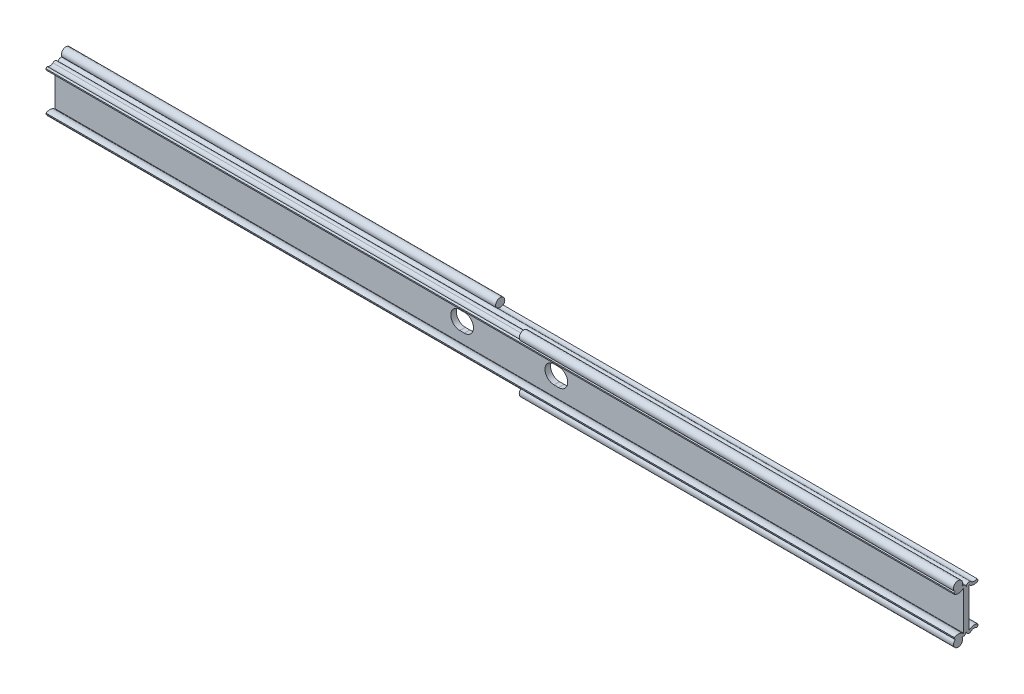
ISO-10303-21;
HEADER;
FILE_DESCRIPTION(('STEP AP214'),'2;1');
FILE_NAME('part.step','',(''),(''),'','','');
FILE_SCHEMA(('AUTOMOTIVE_DESIGN { 1 0 10303 214 1 1 1 1 }'));
ENDSEC;
DATA;
#1=APPLICATION_CONTEXT('core data for automotive mechanical design processes');
#2=APPLICATION_PROTOCOL_DEFINITION('international standard','automotive_design',2000,#1);
#3=PRODUCT_CONTEXT('',#1,'mechanical');
#4=PRODUCT('Part','Part','',(#3));
#5=PRODUCT_RELATED_PRODUCT_CATEGORY('part','',(#4));
#6=PRODUCT_DEFINITION_FORMATION('','',#4);
#7=PRODUCT_DEFINITION_CONTEXT('part definition',#1,'design');
#8=PRODUCT_DEFINITION('design','',#6,#7);
#9=PRODUCT_DEFINITION_SHAPE('','',#8);
#10=(LENGTH_UNIT() NAMED_UNIT(*) SI_UNIT(.MILLI.,.METRE.));
#11=(NAMED_UNIT(*) PLANE_ANGLE_UNIT() SI_UNIT($,.RADIAN.));
#12=(NAMED_UNIT(*) SI_UNIT($,.STERADIAN.) SOLID_ANGLE_UNIT());
#13=UNCERTAINTY_MEASURE_WITH_UNIT(LENGTH_MEASURE(1.E-05),#10,'distance_accuracy_value','');
#14=(GEOMETRIC_REPRESENTATION_CONTEXT(3) GLOBAL_UNCERTAINTY_ASSIGNED_CONTEXT((#13)) GLOBAL_UNIT_ASSIGNED_CONTEXT((#10,
#11,#12)) REPRESENTATION_CONTEXT('',''));
#15=CARTESIAN_POINT('',(0.,0.,0.));
#16=DIRECTION('',(0.,0.,1.));
#17=DIRECTION('',(1.,0.,0.));
#18=AXIS2_PLACEMENT_3D('',#15,#16,#17);
#19=CARTESIAN_POINT('',(-254.,13.9149993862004,4.44999974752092));
#20=DIRECTION('',(1.,0.,0.));
#21=DIRECTION('',(0.,0.,-1.));
#22=AXIS2_PLACEMENT_3D('',#19,#20,#21);
#23=CYLINDRICAL_SURFACE('',#22,2.54999999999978);
#24=CARTESIAN_POINT('',(11.15,13.9149993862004,4.44999974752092));
#25=DIRECTION('',(1.,0.,0.));
#26=DIRECTION('',(0.,0.,-1.));
#27=AXIS2_PLACEMENT_3D('',#24,#25,#26);
#28=CIRCLE('',#27,2.54999999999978);
#29=CARTESIAN_POINT('',(11.15,12.0059660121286,2.75941062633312));
#30=VERTEX_POINT('',#29);
#31=CARTESIAN_POINT('',(11.15,11.8784793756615,5.98462877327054));
#32=VERTEX_POINT('',#31);
#33=EDGE_CURVE('E323',#30,#32,#28,.F.);
#34=ORIENTED_EDGE('',*,*,#33,.F.);
#35=DIRECTION('',(1.,0.,0.));
#36=VECTOR('',#35,1.);
#37=CARTESIAN_POINT('',(-254.,12.0059660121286,2.75941062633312));
#38=LINE('',#37,#36);
#39=CARTESIAN_POINT('',(-254.,12.0059660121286,2.75941062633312));
#40=VERTEX_POINT('',#39);
#41=EDGE_CURVE('E548',#40,#30,#38,.T.);
#42=ORIENTED_EDGE('',*,*,#41,.F.);
#43=CARTESIAN_POINT('',(-254.,13.9149993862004,4.44999974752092));
#44=DIRECTION('',(1.,0.,0.));
#45=DIRECTION('',(0.,0.,1.));
#46=AXIS2_PLACEMENT_3D('',#43,#44,#45);
#47=CIRCLE('',#46,2.54999999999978);
#48=CARTESIAN_POINT('',(-254.,11.8784793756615,5.98462877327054));
#49=VERTEX_POINT('',#48);
#50=EDGE_CURVE('E504',#49,#40,#47,.T.);
#51=ORIENTED_EDGE('',*,*,#50,.F.);
#52=DIRECTION('',(1.,0.,0.));
#53=VECTOR('',#52,1.);
#54=CARTESIAN_POINT('',(-254.,11.8784793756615,5.98462877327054));
#55=LINE('',#54,#53);
#56=EDGE_CURVE('E551',#49,#32,#55,.T.);
#57=ORIENTED_EDGE('',*,*,#56,.T.);
#58=EDGE_LOOP('',(#34,#42,#51,#57));
#59=FACE_BOUND('',#58,.T.);
#60=ADVANCED_FACE('F14',(#59),#23,.F.);
#61=CARTESIAN_POINT('',(-254.,13.9149993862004,-4.44999974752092));
#62=DIRECTION('',(1.,0.,0.));
#63=DIRECTION('',(0.,0.,-1.));
#64=AXIS2_PLACEMENT_3D('',#61,#62,#63);
#65=CYLINDRICAL_SURFACE('',#64,2.54999999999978);
#66=CARTESIAN_POINT('',(-11.15,13.9149993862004,-4.44999974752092));
#67=DIRECTION('',(-1.,0.,0.));
#68=DIRECTION('',(0.,0.,1.));
#69=AXIS2_PLACEMENT_3D('',#66,#67,#68);
#70=CIRCLE('',#69,2.54999999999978);
#71=CARTESIAN_POINT('',(-11.15,12.0059660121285,-2.75941062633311));
#72=VERTEX_POINT('',#71);
#73=CARTESIAN_POINT('',(-11.15,11.8784793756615,-5.98462877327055));
#74=VERTEX_POINT('',#73);
#75=EDGE_CURVE('E357',#72,#74,#70,.F.);
#76=ORIENTED_EDGE('',*,*,#75,.F.);
#77=DIRECTION('',(1.,0.,0.));
#78=VECTOR('',#77,1.);
#79=CARTESIAN_POINT('',(-254.,12.0059660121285,-2.75941062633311));
#80=LINE('',#79,#78);
#81=CARTESIAN_POINT('',(254.,12.0059660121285,-2.75941062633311));
#82=VERTEX_POINT('',#81);
#83=EDGE_CURVE('E543',#72,#82,#80,.T.);
#84=ORIENTED_EDGE('',*,*,#83,.T.);
#85=CARTESIAN_POINT('',(254.,13.9149993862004,-4.44999974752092));
#86=DIRECTION('',(1.,0.,0.));
#87=DIRECTION('',(0.,0.,-1.));
#88=AXIS2_PLACEMENT_3D('',#85,#86,#87);
#89=CIRCLE('',#88,2.54999999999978);
#90=CARTESIAN_POINT('',(254.,11.8784793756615,-5.98462877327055));
#91=VERTEX_POINT('',#90);
#92=EDGE_CURVE('E457',#82,#91,#89,.T.);
#93=ORIENTED_EDGE('',*,*,#92,.T.);
#94=DIRECTION('',(1.,0.,0.));
#95=VECTOR('',#94,1.);
#96=CARTESIAN_POINT('',(-254.,11.8784793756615,-5.98462877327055));
#97=LINE('',#96,#95);
#98=EDGE_CURVE('E541',#74,#91,#97,.T.);
#99=ORIENTED_EDGE('',*,*,#98,.F.);
#100=EDGE_LOOP('',(#76,#84,#93,#99));
#101=FACE_BOUND('',#100,.T.);
#102=ADVANCED_FACE('F682',(#101),#65,.F.);
#103=CARTESIAN_POINT('',(-254.,-13.9149993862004,-4.44999974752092));
#104=DIRECTION('',(1.,0.,0.));
#105=DIRECTION('',(0.,0.,-1.));
#106=AXIS2_PLACEMENT_3D('',#103,#104,#105);
#107=CYLINDRICAL_SURFACE('',#106,4.09999984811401);
#108=CARTESIAN_POINT('',(254.,-13.9149993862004,-4.44999974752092));
#109=DIRECTION('',(-1.,0.,0.));
#110=DIRECTION('',(0.,0.,-1.));
#111=AXIS2_PLACEMENT_3D('',#108,#109,#110);
#112=CIRCLE('',#111,4.09999984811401);
#113=CARTESIAN_POINT('',(254.,-10.8444021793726,-1.73312073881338));
#114=VERTEX_POINT('',#113);
#115=CARTESIAN_POINT('',(254.,-10.4239395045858,-6.59999966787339));
#116=VERTEX_POINT('',#115);
#117=EDGE_CURVE('E423',#114,#116,#112,.T.);
#118=ORIENTED_EDGE('',*,*,#117,.T.);
#119=DIRECTION('',(1.,0.,0.));
#120=VECTOR('',#119,1.);
#121=CARTESIAN_POINT('',(-254.,-10.4239395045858,-6.59999966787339));
#122=LINE('',#121,#120);
#123=CARTESIAN_POINT('',(-254.,-10.4239395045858,-6.59999966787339));
#124=VERTEX_POINT('',#123);
#125=EDGE_CURVE('E591',#124,#116,#122,.T.);
#126=ORIENTED_EDGE('',*,*,#125,.F.);
#127=CARTESIAN_POINT('',(-254.,-13.9149993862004,-4.44999974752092));
#128=DIRECTION('',(-1.,0.,0.));
#129=DIRECTION('',(0.,0.,-1.));
#130=AXIS2_PLACEMENT_3D('',#127,#128,#129);
#131=CIRCLE('',#130,4.09999984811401);
#132=CARTESIAN_POINT('',(-254.,-10.8444021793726,-1.73312073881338));
#133=VERTEX_POINT('',#132);
#134=EDGE_CURVE('E472',#133,#124,#131,.T.);
#135=ORIENTED_EDGE('',*,*,#134,.F.);
#136=DIRECTION('',(1.,0.,0.));
#137=VECTOR('',#136,1.);
#138=CARTESIAN_POINT('',(-254.,-10.8444021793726,-1.73312073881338));
#139=LINE('',#138,#137);
#140=EDGE_CURVE('E523',#133,#114,#139,.T.);
#141=ORIENTED_EDGE('',*,*,#140,.T.);
#142=EDGE_LOOP('',(#118,#126,#135,#141));
#143=FACE_BOUND('',#142,.T.);
#144=ADVANCED_FACE('F16',(#143),#107,.T.);
#145=CARTESIAN_POINT('',(-254.,-11.0618535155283,-6.59999966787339));
#146=DIRECTION('',(0.,0.,1.));
#147=DIRECTION('',(1.,0.,0.));
#148=AXIS2_PLACEMENT_3D('',#145,#146,#147);
#149=PLANE('',#148);
#150=DIRECTION('',(0.,-1.,0.));
#151=VECTOR('',#150,1.);
#152=CARTESIAN_POINT('',(254.,-11.0618535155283,-6.59999966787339));
#153=LINE('',#152,#151);
#154=CARTESIAN_POINT('',(254.,-11.0618535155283,-6.59999966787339));
#155=VERTEX_POINT('',#154);
#156=EDGE_CURVE('E426',#116,#155,#153,.T.);
#157=ORIENTED_EDGE('',*,*,#156,.T.);
#158=DIRECTION('',(1.,0.,0.));
#159=VECTOR('',#158,1.);
#160=CARTESIAN_POINT('',(-254.,-11.0618535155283,-6.59999966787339));
#161=LINE('',#160,#159);
#162=CARTESIAN_POINT('',(-254.,-11.0618535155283,-6.59999966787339));
#163=VERTEX_POINT('',#162);
#164=EDGE_CURVE('E588',#163,#155,#161,.T.);
#165=ORIENTED_EDGE('',*,*,#164,.F.);
#166=DIRECTION('',(0.,-1.,0.));
#167=VECTOR('',#166,1.);
#168=CARTESIAN_POINT('',(-254.,-11.0618535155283,-6.59999966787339));
#169=LINE('',#168,#167);
#170=EDGE_CURVE('E475',#124,#163,#169,.T.);
#171=ORIENTED_EDGE('',*,*,#170,.F.);
#172=ORIENTED_EDGE('',*,*,#125,.T.);
#173=EDGE_LOOP('',(#157,#165,#171,#172));
#174=FACE_BOUND('',#173,.T.);
#175=ADVANCED_FACE('F727',(#174),#149,.F.);
#176=CARTESIAN_POINT('',(-254.,-11.8784793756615,-5.98462877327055));
#177=DIRECTION('',(0.,0.601814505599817,0.79863590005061));
#178=DIRECTION('',(0.,0.79863590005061,-0.601814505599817));
#179=AXIS2_PLACEMENT_3D('',#176,#177,#178);
#180=PLANE('',#179);
#181=DIRECTION('',(0.,0.79863590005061,-0.601814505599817));
#182=VECTOR('',#181,1.);
#183=CARTESIAN_POINT('',(-11.15,-11.8784793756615,-5.98462877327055));
#184=LINE('',#183,#182);
#185=CARTESIAN_POINT('',(-11.15,-11.8784793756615,-5.98462877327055));
#186=VERTEX_POINT('',#185);
#187=CARTESIAN_POINT('',(-11.15,-11.6159967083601,-6.18242338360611));
#188=VERTEX_POINT('',#187);
#189=EDGE_CURVE('E343',#186,#188,#184,.T.);
#190=ORIENTED_EDGE('',*,*,#189,.T.);
#191=DIRECTION('',(-1.,0.,0.));
#192=VECTOR('',#191,1.);
#193=CARTESIAN_POINT('',(-11.15,-11.6159967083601,-6.18242338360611));
#194=LINE('',#193,#192);
#195=CARTESIAN_POINT('',(-254.,-11.6159967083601,-6.18242338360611));
#196=VERTEX_POINT('',#195);
#197=EDGE_CURVE('E337',#188,#196,#194,.T.);
#198=ORIENTED_EDGE('',*,*,#197,.T.);
#199=DIRECTION('',(0.,-0.79863590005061,0.601814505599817));
#200=VECTOR('',#199,1.);
#201=CARTESIAN_POINT('',(-254.,-11.8784793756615,-5.98462877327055));
#202=LINE('',#201,#200);
#203=EDGE_CURVE('E477',#163,#196,#202,.T.);
#204=ORIENTED_EDGE('',*,*,#203,.F.);
#205=ORIENTED_EDGE('',*,*,#164,.T.);
#206=DIRECTION('',(0.,-0.79863590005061,0.601814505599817));
#207=VECTOR('',#206,1.);
#208=CARTESIAN_POINT('',(254.,-11.8784793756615,-5.98462877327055));
#209=LINE('',#208,#207);
#210=CARTESIAN_POINT('',(254.,-11.8784793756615,-5.98462877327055));
#211=VERTEX_POINT('',#210);
#212=EDGE_CURVE('E428',#155,#211,#209,.T.);
#213=ORIENTED_EDGE('',*,*,#212,.T.);
#214=DIRECTION('',(1.,0.,0.));
#215=VECTOR('',#214,1.);
#216=CARTESIAN_POINT('',(-254.,-11.8784793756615,-5.98462877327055));
#217=LINE('',#216,#215);
#218=EDGE_CURVE('E586',#186,#211,#217,.T.);
#219=ORIENTED_EDGE('',*,*,#218,.F.);
#220=EDGE_LOOP('',(#190,#198,#204,#205,#213,#219));
#221=FACE_BOUND('',#220,.T.);
#222=ADVANCED_FACE('F724',(#221),#180,.F.);
#223=CARTESIAN_POINT('',(-254.,-13.9149993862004,-4.44999974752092));
#224=DIRECTION('',(1.,0.,0.));
#225=DIRECTION('',(0.,0.,-1.));
#226=AXIS2_PLACEMENT_3D('',#223,#224,#225);
#227=CYLINDRICAL_SURFACE('',#226,2.54999999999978);
#228=DIRECTION('',(1.,0.,0.));
#229=VECTOR('',#228,1.);
#230=CARTESIAN_POINT('',(-254.,-12.0059660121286,-2.75941062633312));
#231=LINE('',#230,#229);
#232=CARTESIAN_POINT('',(-11.15,-12.0059660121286,-2.75941062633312));
#233=VERTEX_POINT('',#232);
#234=CARTESIAN_POINT('',(254.,-12.0059660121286,-2.75941062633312));
#235=VERTEX_POINT('',#234);
#236=EDGE_CURVE('E584',#233,#235,#231,.T.);
#237=ORIENTED_EDGE('',*,*,#236,.F.);
#238=CARTESIAN_POINT('',(-11.15,-13.9149993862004,-4.44999974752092));
#239=DIRECTION('',(1.,0.,0.));
#240=DIRECTION('',(0.,0.,-1.));
#241=AXIS2_PLACEMENT_3D('',#238,#239,#240);
#242=CIRCLE('',#241,2.54999999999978);
#243=EDGE_CURVE('E340',#233,#186,#242,.F.);
#244=ORIENTED_EDGE('',*,*,#243,.T.);
#245=ORIENTED_EDGE('',*,*,#218,.T.);
#246=CARTESIAN_POINT('',(254.,-13.9149993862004,-4.44999974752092));
#247=DIRECTION('',(1.,0.,0.));
#248=DIRECTION('',(0.,0.,1.));
#249=AXIS2_PLACEMENT_3D('',#246,#247,#248);
#250=CIRCLE('',#249,2.54999999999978);
#251=EDGE_CURVE('E431',#211,#235,#250,.T.);
#252=ORIENTED_EDGE('',*,*,#251,.T.);
#253=EDGE_LOOP('',(#237,#244,#245,#252));
#254=FACE_BOUND('',#253,.T.);
#255=ADVANCED_FACE('F720',(#254),#227,.F.);
#256=CARTESIAN_POINT('',(-254.,-10.7622235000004,-1.65999984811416));
#257=DIRECTION('',(1.,0.,0.));
#258=DIRECTION('',(0.,0.,-1.));
#259=AXIS2_PLACEMENT_3D('',#256,#257,#258);
#260=CYLINDRICAL_SURFACE('',#259,1.65999984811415);
#261=CARTESIAN_POINT('',(-254.,-10.7622235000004,-1.65999984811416));
#262=DIRECTION('',(-1.,0.,0.));
#263=DIRECTION('',(0.,0.,-1.));
#264=AXIS2_PLACEMENT_3D('',#261,#262,#263);
#265=CIRCLE('',#264,1.65999984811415);
#266=CARTESIAN_POINT('',(-254.,-12.2669165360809,-2.36106929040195));
#267=VERTEX_POINT('',#266);
#268=CARTESIAN_POINT('',(-254.,-10.7622235,0.));
#269=VERTEX_POINT('',#268);
#270=EDGE_CURVE('E480',#267,#269,#265,.T.);
#271=ORIENTED_EDGE('',*,*,#270,.F.);
#272=DIRECTION('',(-1.,0.,0.));
#273=VECTOR('',#272,1.);
#274=CARTESIAN_POINT('',(-132.575,-12.2669165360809,-2.36106929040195));
#275=LINE('',#274,#273);
#276=CARTESIAN_POINT('',(-11.15,-12.2669165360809,-2.36106929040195));
#277=VERTEX_POINT('',#276);
#278=EDGE_CURVE('E333',#267,#277,#275,.F.);
#279=ORIENTED_EDGE('',*,*,#278,.T.);
#280=CARTESIAN_POINT('',(-11.15,-10.7622235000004,-1.65999984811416));
#281=DIRECTION('',(1.,0.,0.));
#282=DIRECTION('',(0.,0.,-1.));
#283=AXIS2_PLACEMENT_3D('',#280,#281,#282);
#284=CIRCLE('',#283,1.65999984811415);
#285=EDGE_CURVE('E596',#277,#233,#284,.T.);
#286=ORIENTED_EDGE('',*,*,#285,.T.);
#287=ORIENTED_EDGE('',*,*,#236,.T.);
#288=CARTESIAN_POINT('',(254.,-10.7622235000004,-1.65999984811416));
#289=DIRECTION('',(-1.,0.,0.));
#290=DIRECTION('',(0.,0.,-1.));
#291=AXIS2_PLACEMENT_3D('',#288,#289,#290);
#292=CIRCLE('',#291,1.65999984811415);
#293=CARTESIAN_POINT('',(254.,-10.7622235,0.));
#294=VERTEX_POINT('',#293);
#295=EDGE_CURVE('E434',#235,#294,#292,.T.);
#296=ORIENTED_EDGE('',*,*,#295,.T.);
#297=DIRECTION('',(1.,0.,0.));
#298=VECTOR('',#297,1.);
#299=CARTESIAN_POINT('',(-254.,-10.7622235,0.));
#300=LINE('',#299,#298);
#301=EDGE_CURVE('E581',#269,#294,#300,.T.);
#302=ORIENTED_EDGE('',*,*,#301,.F.);
#303=EDGE_LOOP('',(#271,#279,#286,#287,#296,#302));
#304=FACE_BOUND('',#303,.T.);
#305=ADVANCED_FACE('F717',(#304),#260,.T.);
#306=CARTESIAN_POINT('',(-254.,-10.7622235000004,1.65999984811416));
#307=DIRECTION('',(1.,0.,0.));
#308=DIRECTION('',(0.,0.,-1.));
#309=AXIS2_PLACEMENT_3D('',#306,#307,#308);
#310=CYLINDRICAL_SURFACE('',#309,1.65999984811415);
#311=CARTESIAN_POINT('',(254.,-10.7622235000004,1.65999984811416));
#312=DIRECTION('',(-1.,0.,0.));
#313=DIRECTION('',(0.,0.,1.));
#314=AXIS2_PLACEMENT_3D('',#311,#312,#313);
#315=CIRCLE('',#314,1.65999984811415);
#316=CARTESIAN_POINT('',(254.,-12.2669165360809,2.36106929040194));
#317=VERTEX_POINT('',#316);
#318=EDGE_CURVE('E292',#294,#317,#315,.T.);
#319=ORIENTED_EDGE('',*,*,#318,.T.);
#320=DIRECTION('',(1.,0.,0.));
#321=VECTOR('',#320,1.);
#322=CARTESIAN_POINT('',(132.575,-12.2669165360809,2.36106929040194));
#323=LINE('',#322,#321);
#324=CARTESIAN_POINT('',(11.15,-12.2669165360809,2.36106929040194));
#325=VERTEX_POINT('',#324);
#326=EDGE_CURVE('E29',#317,#325,#323,.F.);
#327=ORIENTED_EDGE('',*,*,#326,.T.);
#328=CARTESIAN_POINT('',(11.15,-10.7622235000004,1.65999984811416));
#329=DIRECTION('',(-1.,0.,0.));
#330=DIRECTION('',(0.,0.,1.));
#331=AXIS2_PLACEMENT_3D('',#328,#329,#330);
#332=CIRCLE('',#331,1.65999984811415);
#333=CARTESIAN_POINT('',(11.15,-12.0059660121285,2.75941062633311));
#334=VERTEX_POINT('',#333);
#335=EDGE_CURVE('E33',#325,#334,#332,.T.);
#336=ORIENTED_EDGE('',*,*,#335,.T.);
#337=DIRECTION('',(1.,0.,0.));
#338=VECTOR('',#337,1.);
#339=CARTESIAN_POINT('',(-254.,-12.0059660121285,2.75941062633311));
#340=LINE('',#339,#338);
#341=CARTESIAN_POINT('',(-254.,-12.0059660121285,2.75941062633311));
#342=VERTEX_POINT('',#341);
#343=EDGE_CURVE('E579',#342,#334,#340,.T.);
#344=ORIENTED_EDGE('',*,*,#343,.F.);
#345=CARTESIAN_POINT('',(-254.,-10.7622235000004,1.65999984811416));
#346=DIRECTION('',(-1.,0.,0.));
#347=DIRECTION('',(0.,0.,1.));
#348=AXIS2_PLACEMENT_3D('',#345,#346,#347);
#349=CIRCLE('',#348,1.65999984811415);
#350=EDGE_CURVE('E482',#269,#342,#349,.T.);
#351=ORIENTED_EDGE('',*,*,#350,.F.);
#352=ORIENTED_EDGE('',*,*,#301,.T.);
#353=EDGE_LOOP('',(#319,#327,#336,#344,#351,#352));
#354=FACE_BOUND('',#353,.T.);
#355=ADVANCED_FACE('F714',(#354),#310,.T.);
#356=CARTESIAN_POINT('',(-254.,-13.9149993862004,4.44999974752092));
#357=DIRECTION('',(1.,0.,0.));
#358=DIRECTION('',(0.,0.,-1.));
#359=AXIS2_PLACEMENT_3D('',#356,#357,#358);
#360=CYLINDRICAL_SURFACE('',#359,2.54999999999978);
#361=ORIENTED_EDGE('',*,*,#343,.T.);
#362=CARTESIAN_POINT('',(11.15,-13.9149993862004,4.44999974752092));
#363=DIRECTION('',(-1.,0.,0.));
#364=DIRECTION('',(0.,0.,1.));
#365=AXIS2_PLACEMENT_3D('',#362,#363,#364);
#366=CIRCLE('',#365,2.54999999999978);
#367=CARTESIAN_POINT('',(11.15,-11.8784793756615,5.98462877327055));
#368=VERTEX_POINT('',#367);
#369=EDGE_CURVE('E309',#334,#368,#366,.F.);
#370=ORIENTED_EDGE('',*,*,#369,.T.);
#371=DIRECTION('',(1.,0.,0.));
#372=VECTOR('',#371,1.);
#373=CARTESIAN_POINT('',(-254.,-11.8784793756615,5.98462877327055));
#374=LINE('',#373,#372);
#375=CARTESIAN_POINT('',(-254.,-11.8784793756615,5.98462877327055));
#376=VERTEX_POINT('',#375);
#377=EDGE_CURVE('E577',#376,#368,#374,.T.);
#378=ORIENTED_EDGE('',*,*,#377,.F.);
#379=CARTESIAN_POINT('',(-254.,-13.9149993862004,4.44999974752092));
#380=DIRECTION('',(1.,0.,0.));
#381=DIRECTION('',(0.,0.,-1.));
#382=AXIS2_PLACEMENT_3D('',#379,#380,#381);
#383=CIRCLE('',#382,2.54999999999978);
#384=EDGE_CURVE('E484',#342,#376,#383,.T.);
#385=ORIENTED_EDGE('',*,*,#384,.F.);
#386=EDGE_LOOP('',(#361,#370,#378,#385));
#387=FACE_BOUND('',#386,.T.);
#388=ADVANCED_FACE('F667',(#387),#360,.F.);
#389=CARTESIAN_POINT('',(-254.,-11.8784793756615,5.98462877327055));
#390=DIRECTION('',(0.,0.601814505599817,-0.79863590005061));
#391=DIRECTION('',(0.,-0.79863590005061,-0.601814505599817));
#392=AXIS2_PLACEMENT_3D('',#389,#390,#391);
#393=PLANE('',#392);
#394=DIRECTION('',(0.,0.79863590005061,0.601814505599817));
#395=VECTOR('',#394,1.);
#396=CARTESIAN_POINT('',(11.15,-11.8784793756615,5.98462877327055));
#397=LINE('',#396,#395);
#398=CARTESIAN_POINT('',(11.15,-11.6159967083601,6.18242338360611));
#399=VERTEX_POINT('',#398);
#400=EDGE_CURVE('E9',#368,#399,#397,.T.);
#401=ORIENTED_EDGE('',*,*,#400,.T.);
#402=DIRECTION('',(1.,0.,0.));
#403=VECTOR('',#402,1.);
#404=CARTESIAN_POINT('',(11.15,-11.6159967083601,6.18242338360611));
#405=LINE('',#404,#403);
#406=CARTESIAN_POINT('',(254.,-11.6159967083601,6.18242338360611));
#407=VERTEX_POINT('',#406);
#408=EDGE_CURVE('E295',#399,#407,#405,.T.);
#409=ORIENTED_EDGE('',*,*,#408,.T.);
#410=DIRECTION('',(0.,0.79863590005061,0.601814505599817));
#411=VECTOR('',#410,1.);
#412=CARTESIAN_POINT('',(254.,-11.8784793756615,5.98462877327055));
#413=LINE('',#412,#411);
#414=CARTESIAN_POINT('',(254.,-11.0618535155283,6.59999966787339));
#415=VERTEX_POINT('',#414);
#416=EDGE_CURVE('E281',#407,#415,#413,.T.);
#417=ORIENTED_EDGE('',*,*,#416,.T.);
#418=DIRECTION('',(1.,0.,0.));
#419=VECTOR('',#418,1.);
#420=CARTESIAN_POINT('',(-254.,-11.0618535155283,6.59999966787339));
#421=LINE('',#420,#419);
#422=CARTESIAN_POINT('',(-254.,-11.0618535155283,6.59999966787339));
#423=VERTEX_POINT('',#422);
#424=EDGE_CURVE('E575',#423,#415,#421,.T.);
#425=ORIENTED_EDGE('',*,*,#424,.F.);
#426=DIRECTION('',(0.,0.79863590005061,0.601814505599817));
#427=VECTOR('',#426,1.);
#428=CARTESIAN_POINT('',(-254.,-11.8784793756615,5.98462877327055));
#429=LINE('',#428,#427);
#430=EDGE_CURVE('E486',#376,#423,#429,.T.);
#431=ORIENTED_EDGE('',*,*,#430,.F.);
#432=ORIENTED_EDGE('',*,*,#377,.T.);
#433=EDGE_LOOP('',(#401,#409,#417,#425,#431,#432));
#434=FACE_BOUND('',#433,.T.);
#435=ADVANCED_FACE('F296',(#434),#393,.F.);
#436=CARTESIAN_POINT('',(-254.,-11.0618535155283,6.59999966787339));
#437=DIRECTION('',(0.,0.,-1.));
#438=DIRECTION('',(-1.,0.,0.));
#439=AXIS2_PLACEMENT_3D('',#436,#437,#438);
#440=PLANE('',#439);
#441=DIRECTION('',(0.,1.,0.));
#442=VECTOR('',#441,1.);
#443=CARTESIAN_POINT('',(254.,-11.0618535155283,6.59999966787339));
#444=LINE('',#443,#442);
#445=CARTESIAN_POINT('',(254.,-10.4239395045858,6.59999966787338));
#446=VERTEX_POINT('',#445);
#447=EDGE_CURVE('E288',#415,#446,#444,.T.);
#448=ORIENTED_EDGE('',*,*,#447,.T.);
#449=DIRECTION('',(1.,0.,0.));
#450=VECTOR('',#449,1.);
#451=CARTESIAN_POINT('',(-254.,-10.4239395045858,6.59999966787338));
#452=LINE('',#451,#450);
#453=CARTESIAN_POINT('',(-254.,-10.4239395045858,6.59999966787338));
#454=VERTEX_POINT('',#453);
#455=EDGE_CURVE('E572',#454,#446,#452,.T.);
#456=ORIENTED_EDGE('',*,*,#455,.F.);
#457=DIRECTION('',(0.,1.,0.));
#458=VECTOR('',#457,1.);
#459=CARTESIAN_POINT('',(-254.,-11.0618535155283,6.59999966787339));
#460=LINE('',#459,#458);
#461=EDGE_CURVE('E488',#423,#454,#460,.T.);
#462=ORIENTED_EDGE('',*,*,#461,.F.);
#463=ORIENTED_EDGE('',*,*,#424,.T.);
#464=EDGE_LOOP('',(#448,#456,#462,#463));
#465=FACE_BOUND('',#464,.T.);
#466=ADVANCED_FACE('F661',(#465),#440,.F.);
#467=CARTESIAN_POINT('',(-254.,-13.9149993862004,4.44999974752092));
#468=DIRECTION('',(1.,0.,0.));
#469=DIRECTION('',(0.,0.,-1.));
#470=AXIS2_PLACEMENT_3D('',#467,#468,#469);
#471=CYLINDRICAL_SURFACE('',#470,4.09999984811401);
#472=CARTESIAN_POINT('',(254.,-13.9149993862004,4.44999974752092));
#473=DIRECTION('',(-1.,0.,0.));
#474=DIRECTION('',(0.,0.,1.));
#475=AXIS2_PLACEMENT_3D('',#472,#473,#474);
#476=CIRCLE('',#475,4.09999984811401);
#477=CARTESIAN_POINT('',(254.,-10.8444021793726,1.73312073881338));
#478=VERTEX_POINT('',#477);
#479=EDGE_CURVE('E438',#446,#478,#476,.T.);
#480=ORIENTED_EDGE('',*,*,#479,.T.);
#481=DIRECTION('',(1.,0.,0.));
#482=VECTOR('',#481,1.);
#483=CARTESIAN_POINT('',(-254.,-10.8444021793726,1.73312073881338));
#484=LINE('',#483,#482);
#485=CARTESIAN_POINT('',(-254.,-10.8444021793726,1.73312073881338));
#486=VERTEX_POINT('',#485);
#487=EDGE_CURVE('E569',#486,#478,#484,.T.);
#488=ORIENTED_EDGE('',*,*,#487,.F.);
#489=CARTESIAN_POINT('',(-254.,-13.9149993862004,4.44999974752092));
#490=DIRECTION('',(-1.,0.,0.));
#491=DIRECTION('',(0.,0.,1.));
#492=AXIS2_PLACEMENT_3D('',#489,#490,#491);
#493=CIRCLE('',#492,4.09999984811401);
#494=EDGE_CURVE('E490',#454,#486,#493,.T.);
#495=ORIENTED_EDGE('',*,*,#494,.F.);
#496=ORIENTED_EDGE('',*,*,#455,.T.);
#497=EDGE_LOOP('',(#480,#488,#495,#496));
#498=FACE_BOUND('',#497,.T.);
#499=ADVANCED_FACE('F657',(#498),#471,.T.);
#500=CARTESIAN_POINT('',(-254.,-10.7622235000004,1.65999984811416));
#501=DIRECTION('',(1.,0.,0.));
#502=DIRECTION('',(0.,0.,-1.));
#503=AXIS2_PLACEMENT_3D('',#500,#501,#502);
#504=CYLINDRICAL_SURFACE('',#503,0.110000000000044);
#505=CARTESIAN_POINT('',(254.,-10.7622235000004,1.65999984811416));
#506=DIRECTION('',(1.,0.,0.));
#507=DIRECTION('',(0.,0.,-1.));
#508=AXIS2_PLACEMENT_3D('',#505,#506,#507);
#509=CIRCLE('',#508,0.110000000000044);
#510=CARTESIAN_POINT('',(254.,-10.7622235,1.5499998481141));
#511=VERTEX_POINT('',#510);
#512=EDGE_CURVE('E440',#478,#511,#509,.T.);
#513=ORIENTED_EDGE('',*,*,#512,.T.);
#514=DIRECTION('',(1.,0.,0.));
#515=VECTOR('',#514,1.);
#516=CARTESIAN_POINT('',(-254.,-10.7622235,1.5499998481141));
#517=LINE('',#516,#515);
#518=CARTESIAN_POINT('',(-254.,-10.7622235,1.5499998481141));
#519=VERTEX_POINT('',#518);
#520=EDGE_CURVE('E566',#519,#511,#517,.T.);
#521=ORIENTED_EDGE('',*,*,#520,.F.);
#522=CARTESIAN_POINT('',(-254.,-10.7622235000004,1.65999984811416));
#523=DIRECTION('',(1.,0.,0.));
#524=DIRECTION('',(0.,0.,-1.));
#525=AXIS2_PLACEMENT_3D('',#522,#523,#524);
#526=CIRCLE('',#525,0.110000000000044);
#527=EDGE_CURVE('E492',#486,#519,#526,.T.);
#528=ORIENTED_EDGE('',*,*,#527,.F.);
#529=ORIENTED_EDGE('',*,*,#487,.T.);
#530=EDGE_LOOP('',(#513,#521,#528,#529));
#531=FACE_BOUND('',#530,.T.);
#532=ADVANCED_FACE('F652',(#531),#504,.F.);
#533=CARTESIAN_POINT('',(-254.,10.7622235,1.5499998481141));
#534=DIRECTION('',(0.,0.,-1.));
#535=DIRECTION('',(-1.,0.,0.));
#536=AXIS2_PLACEMENT_3D('',#533,#534,#535);
#537=PLANE('',#536);
#538=DIRECTION('',(1.,0.,0.));
#539=VECTOR('',#538,1.);
#540=CARTESIAN_POINT('',(27.65,-5.05,1.5499998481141));
#541=LINE('',#540,#539);
#542=CARTESIAN_POINT('',(25.05,-5.05,1.5499998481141));
#543=VERTEX_POINT('',#542);
#544=CARTESIAN_POINT('',(27.65,-5.05,1.5499998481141));
#545=VERTEX_POINT('',#544);
#546=EDGE_CURVE('E371',#543,#545,#541,.T.);
#547=ORIENTED_EDGE('',*,*,#546,.F.);
#548=CARTESIAN_POINT('',(25.05,0.,1.5499998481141));
#549=DIRECTION('',(0.,0.,1.));
#550=DIRECTION('',(1.,0.,0.));
#551=AXIS2_PLACEMENT_3D('',#548,#549,#550);
#552=CIRCLE('',#551,5.05);
#553=CARTESIAN_POINT('',(25.05,5.05,1.5499998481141));
#554=VERTEX_POINT('',#553);
#555=EDGE_CURVE('E369',#554,#543,#552,.T.);
#556=ORIENTED_EDGE('',*,*,#555,.F.);
#557=DIRECTION('',(-1.,0.,0.));
#558=VECTOR('',#557,1.);
#559=CARTESIAN_POINT('',(25.05,5.05,1.5499998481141));
#560=LINE('',#559,#558);
#561=CARTESIAN_POINT('',(27.65,5.05,1.5499998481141));
#562=VERTEX_POINT('',#561);
#563=EDGE_CURVE('E377',#562,#554,#560,.T.);
#564=ORIENTED_EDGE('',*,*,#563,.F.);
#565=CARTESIAN_POINT('',(27.65,0.,1.5499998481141));
#566=DIRECTION('',(0.,0.,1.));
#567=DIRECTION('',(1.,0.,0.));
#568=AXIS2_PLACEMENT_3D('',#565,#566,#567);
#569=CIRCLE('',#568,5.05);
#570=EDGE_CURVE('E374',#545,#562,#569,.T.);
#571=ORIENTED_EDGE('',*,*,#570,.F.);
#572=EDGE_LOOP('',(#547,#556,#564,#571));
#573=FACE_BOUND('',#572,.T.);
#574=DIRECTION('',(1.,0.,0.));
#575=VECTOR('',#574,1.);
#576=CARTESIAN_POINT('',(-27.65,-5.05,1.5499998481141));
#577=LINE('',#576,#575);
#578=CARTESIAN_POINT('',(-27.65,-5.05,1.5499998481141));
#579=VERTEX_POINT('',#578);
#580=CARTESIAN_POINT('',(-25.05,-5.05,1.5499998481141));
#581=VERTEX_POINT('',#580);
#582=EDGE_CURVE('E402',#579,#581,#577,.T.);
#583=ORIENTED_EDGE('',*,*,#582,.F.);
#584=CARTESIAN_POINT('',(-27.65,0.,1.5499998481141));
#585=DIRECTION('',(0.,0.,1.));
#586=DIRECTION('',(-1.,0.,0.));
#587=AXIS2_PLACEMENT_3D('',#584,#585,#586);
#588=CIRCLE('',#587,5.05);
#589=CARTESIAN_POINT('',(-27.65,5.05,1.5499998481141));
#590=VERTEX_POINT('',#589);
#591=EDGE_CURVE('E400',#590,#579,#588,.T.);
#592=ORIENTED_EDGE('',*,*,#591,.F.);
#593=DIRECTION('',(-1.,0.,0.));
#594=VECTOR('',#593,1.);
#595=CARTESIAN_POINT('',(-25.05,5.05,1.5499998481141));
#596=LINE('',#595,#594);
#597=CARTESIAN_POINT('',(-25.05,5.05,1.5499998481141));
#598=VERTEX_POINT('',#597);
#599=EDGE_CURVE('E408',#598,#590,#596,.T.);
#600=ORIENTED_EDGE('',*,*,#599,.F.);
#601=CARTESIAN_POINT('',(-25.05,0.,1.5499998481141));
#602=DIRECTION('',(0.,0.,1.));
#603=DIRECTION('',(-1.,0.,0.));
#604=AXIS2_PLACEMENT_3D('',#601,#602,#603);
#605=CIRCLE('',#604,5.05);
#606=EDGE_CURVE('E405',#581,#598,#605,.T.);
#607=ORIENTED_EDGE('',*,*,#606,.F.);
#608=EDGE_LOOP('',(#583,#592,#600,#607));
#609=FACE_BOUND('',#608,.T.);
#610=DIRECTION('',(0.,1.,0.));
#611=VECTOR('',#610,1.);
#612=CARTESIAN_POINT('',(254.,10.7622235,1.5499998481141));
#613=LINE('',#612,#611);
#614=CARTESIAN_POINT('',(254.,10.7622235,1.54999984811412));
#615=VERTEX_POINT('',#614);
#616=EDGE_CURVE('E442',#511,#615,#613,.T.);
#617=ORIENTED_EDGE('',*,*,#616,.T.);
#618=DIRECTION('',(1.,0.,0.));
#619=VECTOR('',#618,1.);
#620=CARTESIAN_POINT('',(-254.,10.7622235,1.54999984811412));
#621=LINE('',#620,#619);
#622=CARTESIAN_POINT('',(-254.,10.7622235,1.54999984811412));
#623=VERTEX_POINT('',#622);
#624=EDGE_CURVE('E563',#623,#615,#621,.T.);
#625=ORIENTED_EDGE('',*,*,#624,.F.);
#626=DIRECTION('',(0.,1.,0.));
#627=VECTOR('',#626,1.);
#628=CARTESIAN_POINT('',(-254.,10.7622235,1.5499998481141));
#629=LINE('',#628,#627);
#630=EDGE_CURVE('E494',#519,#623,#629,.T.);
#631=ORIENTED_EDGE('',*,*,#630,.F.);
#632=ORIENTED_EDGE('',*,*,#520,.T.);
#633=EDGE_LOOP('',(#617,#625,#631,#632));
#634=FACE_BOUND('',#633,.T.);
#635=ADVANCED_FACE('F648',(#573,#609,#634),#537,.F.);
#636=CARTESIAN_POINT('',(-254.,10.7622235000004,1.65999984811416));
#637=DIRECTION('',(1.,0.,0.));
#638=DIRECTION('',(0.,0.,-1.));
#639=AXIS2_PLACEMENT_3D('',#636,#637,#638);
#640=CYLINDRICAL_SURFACE('',#639,0.110000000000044);
#641=CARTESIAN_POINT('',(254.,10.7622235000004,1.65999984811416));
#642=DIRECTION('',(1.,0.,0.));
#643=DIRECTION('',(0.,0.,1.));
#644=AXIS2_PLACEMENT_3D('',#641,#642,#643);
#645=CIRCLE('',#644,0.110000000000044);
#646=CARTESIAN_POINT('',(254.,10.8444021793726,1.73312073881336));
#647=VERTEX_POINT('',#646);
#648=EDGE_CURVE('E444',#615,#647,#645,.T.);
#649=ORIENTED_EDGE('',*,*,#648,.T.);
#650=DIRECTION('',(1.,0.,0.));
#651=VECTOR('',#650,1.);
#652=CARTESIAN_POINT('',(-254.,10.8444021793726,1.73312073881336));
#653=LINE('',#652,#651);
#654=CARTESIAN_POINT('',(-254.,10.8444021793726,1.73312073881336));
#655=VERTEX_POINT('',#654);
#656=EDGE_CURVE('E560',#655,#647,#653,.T.);
#657=ORIENTED_EDGE('',*,*,#656,.F.);
#658=CARTESIAN_POINT('',(-254.,10.7622235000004,1.65999984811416));
#659=DIRECTION('',(1.,0.,0.));
#660=DIRECTION('',(0.,0.,1.));
#661=AXIS2_PLACEMENT_3D('',#658,#659,#660);
#662=CIRCLE('',#661,0.110000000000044);
#663=EDGE_CURVE('E496',#623,#655,#662,.T.);
#664=ORIENTED_EDGE('',*,*,#663,.F.);
#665=ORIENTED_EDGE('',*,*,#624,.T.);
#666=EDGE_LOOP('',(#649,#657,#664,#665));
#667=FACE_BOUND('',#666,.T.);
#668=ADVANCED_FACE('F644',(#667),#640,.F.);
#669=CARTESIAN_POINT('',(-254.,13.9149993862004,4.44999974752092));
#670=DIRECTION('',(1.,0.,0.));
#671=DIRECTION('',(0.,0.,-1.));
#672=AXIS2_PLACEMENT_3D('',#669,#670,#671);
#673=CYLINDRICAL_SURFACE('',#672,4.09999984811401);
#674=CARTESIAN_POINT('',(254.,13.9149993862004,4.44999974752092));
#675=DIRECTION('',(-1.,0.,0.));
#676=DIRECTION('',(0.,0.,-1.));
#677=AXIS2_PLACEMENT_3D('',#674,#675,#676);
#678=CIRCLE('',#677,4.09999984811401);
#679=CARTESIAN_POINT('',(254.,10.4239395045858,6.59999966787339));
#680=VERTEX_POINT('',#679);
#681=EDGE_CURVE('E446',#647,#680,#678,.T.);
#682=ORIENTED_EDGE('',*,*,#681,.T.);
#683=DIRECTION('',(1.,0.,0.));
#684=VECTOR('',#683,1.);
#685=CARTESIAN_POINT('',(-254.,10.4239395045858,6.59999966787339));
#686=LINE('',#685,#684);
#687=CARTESIAN_POINT('',(-254.,10.4239395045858,6.59999966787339));
#688=VERTEX_POINT('',#687);
#689=EDGE_CURVE('E557',#688,#680,#686,.T.);
#690=ORIENTED_EDGE('',*,*,#689,.F.);
#691=CARTESIAN_POINT('',(-254.,13.9149993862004,4.44999974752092));
#692=DIRECTION('',(-1.,0.,0.));
#693=DIRECTION('',(0.,0.,-1.));
#694=AXIS2_PLACEMENT_3D('',#691,#692,#693);
#695=CIRCLE('',#694,4.09999984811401);
#696=EDGE_CURVE('E498',#655,#688,#695,.T.);
#697=ORIENTED_EDGE('',*,*,#696,.F.);
#698=ORIENTED_EDGE('',*,*,#656,.T.);
#699=EDGE_LOOP('',(#682,#690,#697,#698));
#700=FACE_BOUND('',#699,.T.);
#701=ADVANCED_FACE('F639',(#700),#673,.T.);
#702=CARTESIAN_POINT('',(-254.,11.0618535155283,6.59999966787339));
#703=DIRECTION('',(0.,0.,-1.));
#704=DIRECTION('',(-1.,0.,0.));
#705=AXIS2_PLACEMENT_3D('',#702,#703,#704);
#706=PLANE('',#705);
#707=DIRECTION('',(0.,1.,0.));
#708=VECTOR('',#707,1.);
#709=CARTESIAN_POINT('',(254.,11.0618535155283,6.59999966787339));
#710=LINE('',#709,#708);
#711=CARTESIAN_POINT('',(254.,11.0618535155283,6.59999966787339));
#712=VERTEX_POINT('',#711);
#713=EDGE_CURVE('E448',#680,#712,#710,.T.);
#714=ORIENTED_EDGE('',*,*,#713,.T.);
#715=DIRECTION('',(1.,0.,0.));
#716=VECTOR('',#715,1.);
#717=CARTESIAN_POINT('',(-254.,11.0618535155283,6.59999966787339));
#718=LINE('',#717,#716);
#719=CARTESIAN_POINT('',(-254.,11.0618535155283,6.59999966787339));
#720=VERTEX_POINT('',#719);
#721=EDGE_CURVE('E554',#720,#712,#718,.T.);
#722=ORIENTED_EDGE('',*,*,#721,.F.);
#723=DIRECTION('',(0.,1.,0.));
#724=VECTOR('',#723,1.);
#725=CARTESIAN_POINT('',(-254.,11.0618535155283,6.59999966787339));
#726=LINE('',#725,#724);
#727=EDGE_CURVE('E500',#688,#720,#726,.T.);
#728=ORIENTED_EDGE('',*,*,#727,.F.);
#729=ORIENTED_EDGE('',*,*,#689,.T.);
#730=EDGE_LOOP('',(#714,#722,#728,#729));
#731=FACE_BOUND('',#730,.T.);
#732=ADVANCED_FACE('F633',(#731),#706,.F.);
#733=CARTESIAN_POINT('',(-254.,11.8784793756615,5.98462877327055));
#734=DIRECTION('',(0.,-0.601814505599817,-0.79863590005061));
#735=DIRECTION('',(0.,-0.79863590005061,0.601814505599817));
#736=AXIS2_PLACEMENT_3D('',#733,#734,#735);
#737=PLANE('',#736);
#738=DIRECTION('',(0.,0.79863590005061,-0.601814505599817));
#739=VECTOR('',#738,1.);
#740=CARTESIAN_POINT('',(254.,11.8784793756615,5.98462877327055));
#741=LINE('',#740,#739);
#742=CARTESIAN_POINT('',(254.,11.6159967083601,6.18242338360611));
#743=VERTEX_POINT('',#742);
#744=EDGE_CURVE('E450',#712,#743,#741,.T.);
#745=ORIENTED_EDGE('',*,*,#744,.T.);
#746=DIRECTION('',(1.,0.,0.));
#747=VECTOR('',#746,1.);
#748=CARTESIAN_POINT('',(11.15,11.6159967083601,6.18242338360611));
#749=LINE('',#748,#747);
#750=CARTESIAN_POINT('',(11.15,11.6159967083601,6.18242338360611));
#751=VERTEX_POINT('',#750);
#752=EDGE_CURVE('E321',#743,#751,#749,.F.);
#753=ORIENTED_EDGE('',*,*,#752,.T.);
#754=DIRECTION('',(0.,-0.79863590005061,0.601814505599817));
#755=VECTOR('',#754,1.);
#756=CARTESIAN_POINT('',(11.15,11.8784793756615,5.98462877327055));
#757=LINE('',#756,#755);
#758=EDGE_CURVE('E326',#32,#751,#757,.T.);
#759=ORIENTED_EDGE('',*,*,#758,.F.);
#760=ORIENTED_EDGE('',*,*,#56,.F.);
#761=DIRECTION('',(0.,0.79863590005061,-0.601814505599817));
#762=VECTOR('',#761,1.);
#763=CARTESIAN_POINT('',(-254.,11.8784793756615,5.98462877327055));
#764=LINE('',#763,#762);
#765=EDGE_CURVE('E502',#720,#49,#764,.T.);
#766=ORIENTED_EDGE('',*,*,#765,.F.);
#767=ORIENTED_EDGE('',*,*,#721,.T.);
#768=EDGE_LOOP('',(#745,#753,#759,#760,#766,#767));
#769=FACE_BOUND('',#768,.T.);
#770=ADVANCED_FACE('F629',(#769),#737,.F.);
#771=CARTESIAN_POINT('',(-254.,10.7622235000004,1.65999984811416));
#772=DIRECTION('',(1.,0.,0.));
#773=DIRECTION('',(0.,0.,-1.));
#774=AXIS2_PLACEMENT_3D('',#771,#772,#773);
#775=CYLINDRICAL_SURFACE('',#774,1.65999984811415);
#776=CARTESIAN_POINT('',(11.15,10.7622235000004,1.65999984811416));
#777=DIRECTION('',(1.,0.,0.));
#778=DIRECTION('',(0.,0.,-1.));
#779=AXIS2_PLACEMENT_3D('',#776,#777,#778);
#780=CIRCLE('',#779,1.65999984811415);
#781=CARTESIAN_POINT('',(11.15,12.2669165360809,2.36106929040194));
#782=VERTEX_POINT('',#781);
#783=EDGE_CURVE('E22',#782,#30,#780,.T.);
#784=ORIENTED_EDGE('',*,*,#783,.F.);
#785=DIRECTION('',(1.,0.,0.));
#786=VECTOR('',#785,1.);
#787=CARTESIAN_POINT('',(132.575,12.2669165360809,2.36106929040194));
#788=LINE('',#787,#786);
#789=CARTESIAN_POINT('',(254.,12.2669165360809,2.36106929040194));
#790=VERTEX_POINT('',#789);
#791=EDGE_CURVE('E316',#782,#790,#788,.T.);
#792=ORIENTED_EDGE('',*,*,#791,.T.);
#793=CARTESIAN_POINT('',(254.,10.7622235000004,1.65999984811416));
#794=DIRECTION('',(-1.,0.,0.));
#795=DIRECTION('',(0.,0.,-1.));
#796=AXIS2_PLACEMENT_3D('',#793,#794,#795);
#797=CIRCLE('',#796,1.65999984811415);
#798=CARTESIAN_POINT('',(254.,10.7622235,0.));
#799=VERTEX_POINT('',#798);
#800=EDGE_CURVE('E452',#790,#799,#797,.T.);
#801=ORIENTED_EDGE('',*,*,#800,.T.);
#802=DIRECTION('',(1.,0.,0.));
#803=VECTOR('',#802,1.);
#804=CARTESIAN_POINT('',(-254.,10.7622235,0.));
#805=LINE('',#804,#803);
#806=CARTESIAN_POINT('',(-254.,10.7622235,0.));
#807=VERTEX_POINT('',#806);
#808=EDGE_CURVE('E545',#807,#799,#805,.T.);
#809=ORIENTED_EDGE('',*,*,#808,.F.);
#810=CARTESIAN_POINT('',(-254.,10.7622235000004,1.65999984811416));
#811=DIRECTION('',(-1.,0.,0.));
#812=DIRECTION('',(0.,0.,-1.));
#813=AXIS2_PLACEMENT_3D('',#810,#811,#812);
#814=CIRCLE('',#813,1.65999984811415);
#815=EDGE_CURVE('E506',#40,#807,#814,.T.);
#816=ORIENTED_EDGE('',*,*,#815,.F.);
#817=ORIENTED_EDGE('',*,*,#41,.T.);
#818=EDGE_LOOP('',(#784,#792,#801,#809,#816,#817));
#819=FACE_BOUND('',#818,.T.);
#820=ADVANCED_FACE('F604',(#819),#775,.T.);
#821=CARTESIAN_POINT('',(-254.,10.7622235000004,-1.65999984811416));
#822=DIRECTION('',(1.,0.,0.));
#823=DIRECTION('',(0.,0.,-1.));
#824=AXIS2_PLACEMENT_3D('',#821,#822,#823);
#825=CYLINDRICAL_SURFACE('',#824,1.65999984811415);
#826=CARTESIAN_POINT('',(-11.15,10.7622235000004,-1.65999984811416));
#827=DIRECTION('',(-1.,0.,0.));
#828=DIRECTION('',(0.,0.,1.));
#829=AXIS2_PLACEMENT_3D('',#826,#827,#828);
#830=CIRCLE('',#829,1.65999984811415);
#831=CARTESIAN_POINT('',(-11.15,12.2669165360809,-2.36106929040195));
#832=VERTEX_POINT('',#831);
#833=EDGE_CURVE('E359',#832,#72,#830,.T.);
#834=ORIENTED_EDGE('',*,*,#833,.F.);
#835=DIRECTION('',(-1.,0.,0.));
#836=VECTOR('',#835,1.);
#837=CARTESIAN_POINT('',(-132.575,12.2669165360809,-2.36106929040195));
#838=LINE('',#837,#836);
#839=CARTESIAN_POINT('',(-254.,12.2669165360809,-2.36106929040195));
#840=VERTEX_POINT('',#839);
#841=EDGE_CURVE('E354',#832,#840,#838,.T.);
#842=ORIENTED_EDGE('',*,*,#841,.T.);
#843=CARTESIAN_POINT('',(-254.,10.7622235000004,-1.65999984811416));
#844=DIRECTION('',(-1.,0.,0.));
#845=DIRECTION('',(0.,0.,1.));
#846=AXIS2_PLACEMENT_3D('',#843,#844,#845);
#847=CIRCLE('',#846,1.65999984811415);
#848=EDGE_CURVE('E508',#807,#840,#847,.T.);
#849=ORIENTED_EDGE('',*,*,#848,.F.);
#850=ORIENTED_EDGE('',*,*,#808,.T.);
#851=CARTESIAN_POINT('',(254.,10.7622235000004,-1.65999984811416));
#852=DIRECTION('',(-1.,0.,0.));
#853=DIRECTION('',(0.,0.,1.));
#854=AXIS2_PLACEMENT_3D('',#851,#852,#853);
#855=CIRCLE('',#854,1.65999984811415);
#856=EDGE_CURVE('E454',#799,#82,#855,.T.);
#857=ORIENTED_EDGE('',*,*,#856,.T.);
#858=ORIENTED_EDGE('',*,*,#83,.F.);
#859=EDGE_LOOP('',(#834,#842,#849,#850,#857,#858));
#860=FACE_BOUND('',#859,.T.);
#861=ADVANCED_FACE('F619',(#860),#825,.T.);
#862=CARTESIAN_POINT('',(-254.,11.8784793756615,-5.98462877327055));
#863=DIRECTION('',(0.,-0.601814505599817,0.79863590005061));
#864=DIRECTION('',(0.,0.79863590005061,0.601814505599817));
#865=AXIS2_PLACEMENT_3D('',#862,#863,#864);
#866=PLANE('',#865);
#867=DIRECTION('',(0.,-0.79863590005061,-0.601814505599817));
#868=VECTOR('',#867,1.);
#869=CARTESIAN_POINT('',(-254.,11.8784793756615,-5.98462877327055));
#870=LINE('',#869,#868);
#871=CARTESIAN_POINT('',(-254.,11.6159967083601,-6.18242338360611));
#872=VERTEX_POINT('',#871);
#873=CARTESIAN_POINT('',(-254.,11.0618535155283,-6.59999966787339));
#874=VERTEX_POINT('',#873);
#875=EDGE_CURVE('E511',#872,#874,#870,.T.);
#876=ORIENTED_EDGE('',*,*,#875,.F.);
#877=DIRECTION('',(-1.,0.,0.));
#878=VECTOR('',#877,1.);
#879=CARTESIAN_POINT('',(-11.15,11.6159967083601,-6.18242338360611));
#880=LINE('',#879,#878);
#881=CARTESIAN_POINT('',(-11.15,11.6159967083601,-6.18242338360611));
#882=VERTEX_POINT('',#881);
#883=EDGE_CURVE('E350',#872,#882,#880,.F.);
#884=ORIENTED_EDGE('',*,*,#883,.T.);
#885=DIRECTION('',(0.,-0.79863590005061,-0.601814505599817));
#886=VECTOR('',#885,1.);
#887=CARTESIAN_POINT('',(-11.15,11.8784793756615,-5.98462877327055));
#888=LINE('',#887,#886);
#889=EDGE_CURVE('E594',#74,#882,#888,.T.);
#890=ORIENTED_EDGE('',*,*,#889,.F.);
#891=ORIENTED_EDGE('',*,*,#98,.T.);
#892=DIRECTION('',(0.,-0.79863590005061,-0.601814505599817));
#893=VECTOR('',#892,1.);
#894=CARTESIAN_POINT('',(254.,11.8784793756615,-5.98462877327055));
#895=LINE('',#894,#893);
#896=CARTESIAN_POINT('',(254.,11.0618535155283,-6.59999966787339));
#897=VERTEX_POINT('',#896);
#898=EDGE_CURVE('E460',#91,#897,#895,.T.);
#899=ORIENTED_EDGE('',*,*,#898,.T.);
#900=DIRECTION('',(1.,0.,0.));
#901=VECTOR('',#900,1.);
#902=CARTESIAN_POINT('',(-254.,11.0618535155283,-6.59999966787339));
#903=LINE('',#902,#901);
#904=EDGE_CURVE('E538',#874,#897,#903,.T.);
#905=ORIENTED_EDGE('',*,*,#904,.F.);
#906=EDGE_LOOP('',(#876,#884,#890,#891,#899,#905));
#907=FACE_BOUND('',#906,.T.);
#908=ADVANCED_FACE('F783',(#907),#866,.F.);
#909=CARTESIAN_POINT('',(-254.,11.0618535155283,-6.59999966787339));
#910=DIRECTION('',(0.,0.,1.));
#911=DIRECTION('',(1.,0.,0.));
#912=AXIS2_PLACEMENT_3D('',#909,#910,#911);
#913=PLANE('',#912);
#914=DIRECTION('',(0.,-1.,0.));
#915=VECTOR('',#914,1.);
#916=CARTESIAN_POINT('',(254.,11.0618535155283,-6.59999966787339));
#917=LINE('',#916,#915);
#918=CARTESIAN_POINT('',(254.,10.4239395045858,-6.59999966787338));
#919=VERTEX_POINT('',#918);
#920=EDGE_CURVE('E462',#897,#919,#917,.T.);
#921=ORIENTED_EDGE('',*,*,#920,.T.);
#922=DIRECTION('',(1.,0.,0.));
#923=VECTOR('',#922,1.);
#924=CARTESIAN_POINT('',(-254.,10.4239395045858,-6.59999966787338));
#925=LINE('',#924,#923);
#926=CARTESIAN_POINT('',(-254.,10.4239395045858,-6.59999966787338));
#927=VERTEX_POINT('',#926);
#928=EDGE_CURVE('E535',#927,#919,#925,.T.);
#929=ORIENTED_EDGE('',*,*,#928,.F.);
#930=DIRECTION('',(0.,-1.,0.));
#931=VECTOR('',#930,1.);
#932=CARTESIAN_POINT('',(-254.,11.0618535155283,-6.59999966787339));
#933=LINE('',#932,#931);
#934=EDGE_CURVE('E513',#874,#927,#933,.T.);
#935=ORIENTED_EDGE('',*,*,#934,.F.);
#936=ORIENTED_EDGE('',*,*,#904,.T.);
#937=EDGE_LOOP('',(#921,#929,#935,#936));
#938=FACE_BOUND('',#937,.T.);
#939=ADVANCED_FACE('F779',(#938),#913,.F.);
#940=CARTESIAN_POINT('',(-254.,13.9149993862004,-4.44999974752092));
#941=DIRECTION('',(1.,0.,0.));
#942=DIRECTION('',(0.,0.,-1.));
#943=AXIS2_PLACEMENT_3D('',#940,#941,#942);
#944=CYLINDRICAL_SURFACE('',#943,4.09999984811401);
#945=CARTESIAN_POINT('',(254.,13.9149993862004,-4.44999974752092));
#946=DIRECTION('',(-1.,0.,0.));
#947=DIRECTION('',(0.,0.,1.));
#948=AXIS2_PLACEMENT_3D('',#945,#946,#947);
#949=CIRCLE('',#948,4.09999984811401);
#950=CARTESIAN_POINT('',(254.,10.8444021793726,-1.73312073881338));
#951=VERTEX_POINT('',#950);
#952=EDGE_CURVE('E464',#919,#951,#949,.T.);
#953=ORIENTED_EDGE('',*,*,#952,.T.);
#954=DIRECTION('',(1.,0.,0.));
#955=VECTOR('',#954,1.);
#956=CARTESIAN_POINT('',(-254.,10.8444021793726,-1.73312073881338));
#957=LINE('',#956,#955);
#958=CARTESIAN_POINT('',(-254.,10.8444021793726,-1.73312073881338));
#959=VERTEX_POINT('',#958);
#960=EDGE_CURVE('E532',#959,#951,#957,.T.);
#961=ORIENTED_EDGE('',*,*,#960,.F.);
#962=CARTESIAN_POINT('',(-254.,13.9149993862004,-4.44999974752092));
#963=DIRECTION('',(-1.,0.,0.));
#964=DIRECTION('',(0.,0.,1.));
#965=AXIS2_PLACEMENT_3D('',#962,#963,#964);
#966=CIRCLE('',#965,4.09999984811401);
#967=EDGE_CURVE('E515',#927,#959,#966,.T.);
#968=ORIENTED_EDGE('',*,*,#967,.F.);
#969=ORIENTED_EDGE('',*,*,#928,.T.);
#970=EDGE_LOOP('',(#953,#961,#968,#969));
#971=FACE_BOUND('',#970,.T.);
#972=ADVANCED_FACE('F774',(#971),#944,.T.);
#973=CARTESIAN_POINT('',(-254.,10.7622235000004,-1.65999984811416));
#974=DIRECTION('',(1.,0.,0.));
#975=DIRECTION('',(0.,0.,-1.));
#976=AXIS2_PLACEMENT_3D('',#973,#974,#975);
#977=CYLINDRICAL_SURFACE('',#976,0.110000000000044);
#978=CARTESIAN_POINT('',(254.,10.7622235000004,-1.65999984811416));
#979=DIRECTION('',(1.,0.,0.));
#980=DIRECTION('',(0.,0.,-1.));
#981=AXIS2_PLACEMENT_3D('',#978,#979,#980);
#982=CIRCLE('',#981,0.110000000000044);
#983=CARTESIAN_POINT('',(254.,10.7622235,-1.5499998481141));
#984=VERTEX_POINT('',#983);
#985=EDGE_CURVE('E466',#951,#984,#982,.T.);
#986=ORIENTED_EDGE('',*,*,#985,.T.);
#987=DIRECTION('',(1.,0.,0.));
#988=VECTOR('',#987,1.);
#989=CARTESIAN_POINT('',(-254.,10.7622235,-1.5499998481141));
#990=LINE('',#989,#988);
#991=CARTESIAN_POINT('',(-254.,10.7622235,-1.5499998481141));
#992=VERTEX_POINT('',#991);
#993=EDGE_CURVE('E529',#992,#984,#990,.T.);
#994=ORIENTED_EDGE('',*,*,#993,.F.);
#995=CARTESIAN_POINT('',(-254.,10.7622235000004,-1.65999984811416));
#996=DIRECTION('',(1.,0.,0.));
#997=DIRECTION('',(0.,0.,-1.));
#998=AXIS2_PLACEMENT_3D('',#995,#996,#997);
#999=CIRCLE('',#998,0.110000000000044);
#1000=EDGE_CURVE('E517',#959,#992,#999,.T.);
#1001=ORIENTED_EDGE('',*,*,#1000,.F.);
#1002=ORIENTED_EDGE('',*,*,#960,.T.);
#1003=EDGE_LOOP('',(#986,#994,#1001,#1002));
#1004=FACE_BOUND('',#1003,.T.);
#1005=ADVANCED_FACE('F768',(#1004),#977,.F.);
#1006=CARTESIAN_POINT('',(-254.,10.7622235,-1.5499998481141));
#1007=DIRECTION('',(0.,0.,1.));
#1008=DIRECTION('',(1.,0.,0.));
#1009=AXIS2_PLACEMENT_3D('',#1006,#1007,#1008);
#1010=PLANE('',#1009);
#1011=DIRECTION('',(1.,0.,0.));
#1012=VECTOR('',#1011,1.);
#1013=CARTESIAN_POINT('',(25.05,5.05,-1.5499998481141));
#1014=LINE('',#1013,#1012);
#1015=CARTESIAN_POINT('',(25.05,5.05,-1.5499998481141));
#1016=VERTEX_POINT('',#1015);
#1017=CARTESIAN_POINT('',(27.65,5.05,-1.5499998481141));
#1018=VERTEX_POINT('',#1017);
#1019=EDGE_CURVE('E363',#1016,#1018,#1014,.T.);
#1020=ORIENTED_EDGE('',*,*,#1019,.F.);
#1021=CARTESIAN_POINT('',(25.05,0.,-1.5499998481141));
#1022=DIRECTION('',(0.,0.,1.));
#1023=DIRECTION('',(1.,0.,0.));
#1024=AXIS2_PLACEMENT_3D('',#1021,#1022,#1023);
#1025=CIRCLE('',#1024,5.05);
#1026=CARTESIAN_POINT('',(25.05,-5.05,-1.5499998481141));
#1027=VERTEX_POINT('',#1026);
#1028=EDGE_CURVE('E366',#1027,#1016,#1025,.F.);
#1029=ORIENTED_EDGE('',*,*,#1028,.F.);
#1030=DIRECTION('',(-1.,0.,0.));
#1031=VECTOR('',#1030,1.);
#1032=CARTESIAN_POINT('',(27.65,-5.05,-1.5499998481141));
#1033=LINE('',#1032,#1031);
#1034=CARTESIAN_POINT('',(27.65,-5.05,-1.5499998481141));
#1035=VERTEX_POINT('',#1034);
#1036=EDGE_CURVE('E383',#1035,#1027,#1033,.T.);
#1037=ORIENTED_EDGE('',*,*,#1036,.F.);
#1038=CARTESIAN_POINT('',(27.65,0.,-1.5499998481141));
#1039=DIRECTION('',(0.,0.,1.));
#1040=DIRECTION('',(1.,0.,0.));
#1041=AXIS2_PLACEMENT_3D('',#1038,#1039,#1040);
#1042=CIRCLE('',#1041,5.05);
#1043=EDGE_CURVE('E361',#1018,#1035,#1042,.F.);
#1044=ORIENTED_EDGE('',*,*,#1043,.F.);
#1045=EDGE_LOOP('',(#1020,#1029,#1037,#1044));
#1046=FACE_BOUND('',#1045,.T.);
#1047=DIRECTION('',(1.,0.,0.));
#1048=VECTOR('',#1047,1.);
#1049=CARTESIAN_POINT('',(-25.05,5.05,-1.5499998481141));
#1050=LINE('',#1049,#1048);
#1051=CARTESIAN_POINT('',(-27.65,5.05,-1.5499998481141));
#1052=VERTEX_POINT('',#1051);
#1053=CARTESIAN_POINT('',(-25.05,5.05,-1.5499998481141));
#1054=VERTEX_POINT('',#1053);
#1055=EDGE_CURVE('E394',#1052,#1054,#1050,.T.);
#1056=ORIENTED_EDGE('',*,*,#1055,.F.);
#1057=CARTESIAN_POINT('',(-27.65,0.,-1.5499998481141));
#1058=DIRECTION('',(0.,0.,1.));
#1059=DIRECTION('',(1.,0.,0.));
#1060=AXIS2_PLACEMENT_3D('',#1057,#1058,#1059);
#1061=CIRCLE('',#1060,5.05);
#1062=CARTESIAN_POINT('',(-27.65,-5.05,-1.5499998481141));
#1063=VERTEX_POINT('',#1062);
#1064=EDGE_CURVE('E397',#1063,#1052,#1061,.F.);
#1065=ORIENTED_EDGE('',*,*,#1064,.F.);
#1066=DIRECTION('',(-1.,0.,0.));
#1067=VECTOR('',#1066,1.);
#1068=CARTESIAN_POINT('',(-27.65,-5.05,-1.5499998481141));
#1069=LINE('',#1068,#1067);
#1070=CARTESIAN_POINT('',(-25.05,-5.05,-1.5499998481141));
#1071=VERTEX_POINT('',#1070);
#1072=EDGE_CURVE('E414',#1071,#1063,#1069,.T.);
#1073=ORIENTED_EDGE('',*,*,#1072,.F.);
#1074=CARTESIAN_POINT('',(-25.05,0.,-1.5499998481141));
#1075=DIRECTION('',(0.,0.,1.));
#1076=DIRECTION('',(1.,0.,0.));
#1077=AXIS2_PLACEMENT_3D('',#1074,#1075,#1076);
#1078=CIRCLE('',#1077,5.05);
#1079=EDGE_CURVE('E392',#1054,#1071,#1078,.F.);
#1080=ORIENTED_EDGE('',*,*,#1079,.F.);
#1081=EDGE_LOOP('',(#1056,#1065,#1073,#1080));
#1082=FACE_BOUND('',#1081,.T.);
#1083=DIRECTION('',(0.,-1.,0.));
#1084=VECTOR('',#1083,1.);
#1085=CARTESIAN_POINT('',(254.,10.7622235,-1.5499998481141));
#1086=LINE('',#1085,#1084);
#1087=CARTESIAN_POINT('',(254.,-10.7622235,-1.54999984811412));
#1088=VERTEX_POINT('',#1087);
#1089=EDGE_CURVE('E468',#984,#1088,#1086,.T.);
#1090=ORIENTED_EDGE('',*,*,#1089,.T.);
#1091=DIRECTION('',(1.,0.,0.));
#1092=VECTOR('',#1091,1.);
#1093=CARTESIAN_POINT('',(-254.,-10.7622235,-1.54999984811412));
#1094=LINE('',#1093,#1092);
#1095=CARTESIAN_POINT('',(-254.,-10.7622235,-1.54999984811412));
#1096=VERTEX_POINT('',#1095);
#1097=EDGE_CURVE('E526',#1096,#1088,#1094,.T.);
#1098=ORIENTED_EDGE('',*,*,#1097,.F.);
#1099=DIRECTION('',(0.,-1.,0.));
#1100=VECTOR('',#1099,1.);
#1101=CARTESIAN_POINT('',(-254.,10.7622235,-1.5499998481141));
#1102=LINE('',#1101,#1100);
#1103=EDGE_CURVE('E519',#992,#1096,#1102,.T.);
#1104=ORIENTED_EDGE('',*,*,#1103,.F.);
#1105=ORIENTED_EDGE('',*,*,#993,.T.);
#1106=EDGE_LOOP('',(#1090,#1098,#1104,#1105));
#1107=FACE_BOUND('',#1106,.T.);
#1108=ADVANCED_FACE('F764',(#1046,#1082,#1107),#1010,.F.);
#1109=CARTESIAN_POINT('',(-254.,-10.7622235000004,-1.65999984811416));
#1110=DIRECTION('',(1.,0.,0.));
#1111=DIRECTION('',(0.,0.,-1.));
#1112=AXIS2_PLACEMENT_3D('',#1109,#1110,#1111);
#1113=CYLINDRICAL_SURFACE('',#1112,0.110000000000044);
#1114=CARTESIAN_POINT('',(254.,-10.7622235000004,-1.65999984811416));
#1115=DIRECTION('',(1.,0.,0.));
#1116=DIRECTION('',(0.,0.,1.));
#1117=AXIS2_PLACEMENT_3D('',#1114,#1115,#1116);
#1118=CIRCLE('',#1117,0.110000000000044);
#1119=EDGE_CURVE('E470',#1088,#114,#1118,.T.);
#1120=ORIENTED_EDGE('',*,*,#1119,.T.);
#1121=ORIENTED_EDGE('',*,*,#140,.F.);
#1122=CARTESIAN_POINT('',(-254.,-10.7622235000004,-1.65999984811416));
#1123=DIRECTION('',(1.,0.,0.));
#1124=DIRECTION('',(0.,0.,1.));
#1125=AXIS2_PLACEMENT_3D('',#1122,#1123,#1124);
#1126=CIRCLE('',#1125,0.110000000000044);
#1127=EDGE_CURVE('E521',#1096,#133,#1126,.T.);
#1128=ORIENTED_EDGE('',*,*,#1127,.F.);
#1129=ORIENTED_EDGE('',*,*,#1097,.T.);
#1130=EDGE_LOOP('',(#1120,#1121,#1128,#1129));
#1131=FACE_BOUND('',#1130,.T.);
#1132=ADVANCED_FACE('F760',(#1131),#1113,.F.);
#1133=CARTESIAN_POINT('',(-254.,-13.9149993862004,-4.44999974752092));
#1134=DIRECTION('',(1.,0.,0.));
#1135=DIRECTION('',(0.,0.,-1.));
#1136=AXIS2_PLACEMENT_3D('',#1133,#1134,#1135);
#1137=PLANE('',#1136);
#1138=ORIENTED_EDGE('',*,*,#203,.T.);
#1139=CARTESIAN_POINT('',(-254.,-13.575,-4.55));
#1140=DIRECTION('',(-1.,0.,0.));
#1141=DIRECTION('',(0.,0.,-1.));
#1142=AXIS2_PLACEMENT_3D('',#1139,#1140,#1141);
#1143=CIRCLE('',#1142,2.55);
#1144=EDGE_CURVE('E329',#196,#267,#1143,.T.);
#1145=ORIENTED_EDGE('',*,*,#1144,.T.);
#1146=ORIENTED_EDGE('',*,*,#270,.T.);
#1147=ORIENTED_EDGE('',*,*,#350,.T.);
#1148=ORIENTED_EDGE('',*,*,#384,.T.);
#1149=ORIENTED_EDGE('',*,*,#430,.T.);
#1150=ORIENTED_EDGE('',*,*,#461,.T.);
#1151=ORIENTED_EDGE('',*,*,#494,.T.);
#1152=ORIENTED_EDGE('',*,*,#527,.T.);
#1153=ORIENTED_EDGE('',*,*,#630,.T.);
#1154=ORIENTED_EDGE('',*,*,#663,.T.);
#1155=ORIENTED_EDGE('',*,*,#696,.T.);
#1156=ORIENTED_EDGE('',*,*,#727,.T.);
#1157=ORIENTED_EDGE('',*,*,#765,.T.);
#1158=ORIENTED_EDGE('',*,*,#50,.T.);
#1159=ORIENTED_EDGE('',*,*,#815,.T.);
#1160=ORIENTED_EDGE('',*,*,#848,.T.);
#1161=CARTESIAN_POINT('',(-254.,13.575,-4.55));
#1162=DIRECTION('',(-1.,0.,0.));
#1163=DIRECTION('',(0.,0.,1.));
#1164=AXIS2_PLACEMENT_3D('',#1161,#1162,#1163);
#1165=CIRCLE('',#1164,2.55);
#1166=EDGE_CURVE('E346',#840,#872,#1165,.T.);
#1167=ORIENTED_EDGE('',*,*,#1166,.T.);
#1168=ORIENTED_EDGE('',*,*,#875,.T.);
#1169=ORIENTED_EDGE('',*,*,#934,.T.);
#1170=ORIENTED_EDGE('',*,*,#967,.T.);
#1171=ORIENTED_EDGE('',*,*,#1000,.T.);
#1172=ORIENTED_EDGE('',*,*,#1103,.T.);
#1173=ORIENTED_EDGE('',*,*,#1127,.T.);
#1174=ORIENTED_EDGE('',*,*,#134,.T.);
#1175=ORIENTED_EDGE('',*,*,#170,.T.);
#1176=EDGE_LOOP('',(#1138,#1145,#1146,#1147,#1148,#1149,#1150,#1151,#1152,#1153,#1154,#1155,
#1156,#1157,#1158,#1159,#1160,#1167,#1168,#1169,#1170,#1171,#1172,#1173,#1174,#1175));
#1177=FACE_BOUND('',#1176,.T.);
#1178=ADVANCED_FACE('F622',(#1177),#1137,.F.);
#1179=CARTESIAN_POINT('',(254.,-13.9149993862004,-4.44999974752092));
#1180=DIRECTION('',(1.,0.,0.));
#1181=DIRECTION('',(0.,0.,-1.));
#1182=AXIS2_PLACEMENT_3D('',#1179,#1180,#1181);
#1183=PLANE('',#1182);
#1184=ORIENTED_EDGE('',*,*,#416,.F.);
#1185=CARTESIAN_POINT('',(254.,-13.575,4.55));
#1186=DIRECTION('',(1.,0.,0.));
#1187=DIRECTION('',(0.,0.,1.));
#1188=AXIS2_PLACEMENT_3D('',#1185,#1186,#1187);
#1189=CIRCLE('',#1188,2.55);
#1190=EDGE_CURVE('E286',#407,#317,#1189,.T.);
#1191=ORIENTED_EDGE('',*,*,#1190,.T.);
#1192=ORIENTED_EDGE('',*,*,#318,.F.);
#1193=ORIENTED_EDGE('',*,*,#295,.F.);
#1194=ORIENTED_EDGE('',*,*,#251,.F.);
#1195=ORIENTED_EDGE('',*,*,#212,.F.);
#1196=ORIENTED_EDGE('',*,*,#156,.F.);
#1197=ORIENTED_EDGE('',*,*,#117,.F.);
#1198=ORIENTED_EDGE('',*,*,#1119,.F.);
#1199=ORIENTED_EDGE('',*,*,#1089,.F.);
#1200=ORIENTED_EDGE('',*,*,#985,.F.);
#1201=ORIENTED_EDGE('',*,*,#952,.F.);
#1202=ORIENTED_EDGE('',*,*,#920,.F.);
#1203=ORIENTED_EDGE('',*,*,#898,.F.);
#1204=ORIENTED_EDGE('',*,*,#92,.F.);
#1205=ORIENTED_EDGE('',*,*,#856,.F.);
#1206=ORIENTED_EDGE('',*,*,#800,.F.);
#1207=CARTESIAN_POINT('',(254.,13.575,4.55));
#1208=DIRECTION('',(1.,0.,0.));
#1209=DIRECTION('',(0.,0.,-1.));
#1210=AXIS2_PLACEMENT_3D('',#1207,#1208,#1209);
#1211=CIRCLE('',#1210,2.55);
#1212=EDGE_CURVE('E312',#790,#743,#1211,.T.);
#1213=ORIENTED_EDGE('',*,*,#1212,.T.);
#1214=ORIENTED_EDGE('',*,*,#744,.F.);
#1215=ORIENTED_EDGE('',*,*,#713,.F.);
#1216=ORIENTED_EDGE('',*,*,#681,.F.);
#1217=ORIENTED_EDGE('',*,*,#648,.F.);
#1218=ORIENTED_EDGE('',*,*,#616,.F.);
#1219=ORIENTED_EDGE('',*,*,#512,.F.);
#1220=ORIENTED_EDGE('',*,*,#479,.F.);
#1221=ORIENTED_EDGE('',*,*,#447,.F.);
#1222=EDGE_LOOP('',(#1184,#1191,#1192,#1193,#1194,#1195,#1196,#1197,#1198,#1199,#1200,#1201,
#1202,#1203,#1204,#1205,#1206,#1213,#1214,#1215,#1216,#1217,#1218,#1219,#1220,#1221));
#1223=FACE_BOUND('',#1222,.T.);
#1224=ADVANCED_FACE('F283',(#1223),#1183,.T.);
#1225=CARTESIAN_POINT('',(-27.65,0.,-6.60099966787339));
#1226=DIRECTION('',(0.,0.,1.));
#1227=DIRECTION('',(1.,0.,0.));
#1228=AXIS2_PLACEMENT_3D('',#1225,#1226,#1227);
#1229=CYLINDRICAL_SURFACE('',#1228,5.05);
#1230=ORIENTED_EDGE('',*,*,#1064,.T.);
#1231=DIRECTION('',(0.,0.,1.));
#1232=VECTOR('',#1231,1.);
#1233=CARTESIAN_POINT('',(-27.65,5.05,-6.60099966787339));
#1234=LINE('',#1233,#1232);
#1235=EDGE_CURVE('E412',#1052,#590,#1234,.T.);
#1236=ORIENTED_EDGE('',*,*,#1235,.T.);
#1237=ORIENTED_EDGE('',*,*,#591,.T.);
#1238=DIRECTION('',(0.,0.,1.));
#1239=VECTOR('',#1238,1.);
#1240=CARTESIAN_POINT('',(-27.65,-5.05,-6.60099966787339));
#1241=LINE('',#1240,#1239);
#1242=EDGE_CURVE('E411',#1063,#579,#1241,.T.);
#1243=ORIENTED_EDGE('',*,*,#1242,.F.);
#1244=EDGE_LOOP('',(#1230,#1236,#1237,#1243));
#1245=FACE_BOUND('',#1244,.T.);
#1246=ADVANCED_FACE('F823',(#1245),#1229,.F.);
#1247=CARTESIAN_POINT('',(-25.05,5.05,-6.60099966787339));
#1248=DIRECTION('',(0.,1.,0.));
#1249=DIRECTION('',(-1.,0.,0.));
#1250=AXIS2_PLACEMENT_3D('',#1247,#1248,#1249);
#1251=PLANE('',#1250);
#1252=ORIENTED_EDGE('',*,*,#1055,.T.);
#1253=DIRECTION('',(0.,0.,1.));
#1254=VECTOR('',#1253,1.);
#1255=CARTESIAN_POINT('',(-25.05,5.05,-6.60099966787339));
#1256=LINE('',#1255,#1254);
#1257=EDGE_CURVE('E415',#1054,#598,#1256,.T.);
#1258=ORIENTED_EDGE('',*,*,#1257,.T.);
#1259=ORIENTED_EDGE('',*,*,#599,.T.);
#1260=ORIENTED_EDGE('',*,*,#1235,.F.);
#1261=EDGE_LOOP('',(#1252,#1258,#1259,#1260));
#1262=FACE_BOUND('',#1261,.T.);
#1263=ADVANCED_FACE('F819',(#1262),#1251,.F.);
#1264=CARTESIAN_POINT('',(-25.05,0.,-6.60099966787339));
#1265=DIRECTION('',(0.,0.,1.));
#1266=DIRECTION('',(1.,0.,0.));
#1267=AXIS2_PLACEMENT_3D('',#1264,#1265,#1266);
#1268=CYLINDRICAL_SURFACE('',#1267,5.05);
#1269=ORIENTED_EDGE('',*,*,#1079,.T.);
#1270=DIRECTION('',(0.,0.,1.));
#1271=VECTOR('',#1270,1.);
#1272=CARTESIAN_POINT('',(-25.05,-5.05,-6.60099966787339));
#1273=LINE('',#1272,#1271);
#1274=EDGE_CURVE('E417',#1071,#581,#1273,.T.);
#1275=ORIENTED_EDGE('',*,*,#1274,.T.);
#1276=ORIENTED_EDGE('',*,*,#606,.T.);
#1277=ORIENTED_EDGE('',*,*,#1257,.F.);
#1278=EDGE_LOOP('',(#1269,#1275,#1276,#1277));
#1279=FACE_BOUND('',#1278,.T.);
#1280=ADVANCED_FACE('F822',(#1279),#1268,.F.);
#1281=CARTESIAN_POINT('',(-27.65,-5.05,-6.60099966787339));
#1282=DIRECTION('',(0.,-1.,0.));
#1283=DIRECTION('',(1.,0.,0.));
#1284=AXIS2_PLACEMENT_3D('',#1281,#1282,#1283);
#1285=PLANE('',#1284);
#1286=ORIENTED_EDGE('',*,*,#1072,.T.);
#1287=ORIENTED_EDGE('',*,*,#1242,.T.);
#1288=ORIENTED_EDGE('',*,*,#582,.T.);
#1289=ORIENTED_EDGE('',*,*,#1274,.F.);
#1290=EDGE_LOOP('',(#1286,#1287,#1288,#1289));
#1291=FACE_BOUND('',#1290,.T.);
#1292=ADVANCED_FACE('F817',(#1291),#1285,.F.);
#1293=CARTESIAN_POINT('',(25.05,0.,-6.60099966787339));
#1294=DIRECTION('',(0.,0.,1.));
#1295=DIRECTION('',(1.,0.,0.));
#1296=AXIS2_PLACEMENT_3D('',#1293,#1294,#1295);
#1297=CYLINDRICAL_SURFACE('',#1296,5.05);
#1298=ORIENTED_EDGE('',*,*,#1028,.T.);
#1299=DIRECTION('',(0.,0.,1.));
#1300=VECTOR('',#1299,1.);
#1301=CARTESIAN_POINT('',(25.05,5.05,-6.60099966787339));
#1302=LINE('',#1301,#1300);
#1303=EDGE_CURVE('E381',#1016,#554,#1302,.T.);
#1304=ORIENTED_EDGE('',*,*,#1303,.T.);
#1305=ORIENTED_EDGE('',*,*,#555,.T.);
#1306=DIRECTION('',(0.,0.,1.));
#1307=VECTOR('',#1306,1.);
#1308=CARTESIAN_POINT('',(25.05,-5.05,-6.60099966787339));
#1309=LINE('',#1308,#1307);
#1310=EDGE_CURVE('E380',#1027,#543,#1309,.T.);
#1311=ORIENTED_EDGE('',*,*,#1310,.F.);
#1312=EDGE_LOOP('',(#1298,#1304,#1305,#1311));
#1313=FACE_BOUND('',#1312,.T.);
#1314=ADVANCED_FACE('F807',(#1313),#1297,.F.);
#1315=CARTESIAN_POINT('',(25.05,5.05,-6.60099966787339));
#1316=DIRECTION('',(0.,1.,0.));
#1317=DIRECTION('',(-1.,0.,0.));
#1318=AXIS2_PLACEMENT_3D('',#1315,#1316,#1317);
#1319=PLANE('',#1318);
#1320=ORIENTED_EDGE('',*,*,#1019,.T.);
#1321=DIRECTION('',(0.,0.,1.));
#1322=VECTOR('',#1321,1.);
#1323=CARTESIAN_POINT('',(27.65,5.05,-6.60099966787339));
#1324=LINE('',#1323,#1322);
#1325=EDGE_CURVE('E384',#1018,#562,#1324,.T.);
#1326=ORIENTED_EDGE('',*,*,#1325,.T.);
#1327=ORIENTED_EDGE('',*,*,#563,.T.);
#1328=ORIENTED_EDGE('',*,*,#1303,.F.);
#1329=EDGE_LOOP('',(#1320,#1326,#1327,#1328));
#1330=FACE_BOUND('',#1329,.T.);
#1331=ADVANCED_FACE('F803',(#1330),#1319,.F.);
#1332=CARTESIAN_POINT('',(27.65,0.,-6.60099966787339));
#1333=DIRECTION('',(0.,0.,1.));
#1334=DIRECTION('',(1.,0.,0.));
#1335=AXIS2_PLACEMENT_3D('',#1332,#1333,#1334);
#1336=CYLINDRICAL_SURFACE('',#1335,5.05);
#1337=ORIENTED_EDGE('',*,*,#1043,.T.);
#1338=DIRECTION('',(0.,0.,1.));
#1339=VECTOR('',#1338,1.);
#1340=CARTESIAN_POINT('',(27.65,-5.05,-6.60099966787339));
#1341=LINE('',#1340,#1339);
#1342=EDGE_CURVE('E386',#1035,#545,#1341,.T.);
#1343=ORIENTED_EDGE('',*,*,#1342,.T.);
#1344=ORIENTED_EDGE('',*,*,#570,.T.);
#1345=ORIENTED_EDGE('',*,*,#1325,.F.);
#1346=EDGE_LOOP('',(#1337,#1343,#1344,#1345));
#1347=FACE_BOUND('',#1346,.T.);
#1348=ADVANCED_FACE('F806',(#1347),#1336,.F.);
#1349=CARTESIAN_POINT('',(27.65,-5.05,-6.60099966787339));
#1350=DIRECTION('',(0.,-1.,0.));
#1351=DIRECTION('',(1.,0.,0.));
#1352=AXIS2_PLACEMENT_3D('',#1349,#1350,#1351);
#1353=PLANE('',#1352);
#1354=ORIENTED_EDGE('',*,*,#1036,.T.);
#1355=ORIENTED_EDGE('',*,*,#1310,.T.);
#1356=ORIENTED_EDGE('',*,*,#546,.T.);
#1357=ORIENTED_EDGE('',*,*,#1342,.F.);
#1358=EDGE_LOOP('',(#1354,#1355,#1356,#1357));
#1359=FACE_BOUND('',#1358,.T.);
#1360=ADVANCED_FACE('F800',(#1359),#1353,.F.);
#1361=CARTESIAN_POINT('',(-11.15,13.575,-4.55));
#1362=DIRECTION('',(-1.,0.,0.));
#1363=DIRECTION('',(0.,0.,1.));
#1364=AXIS2_PLACEMENT_3D('',#1361,#1362,#1363);
#1365=PLANE('',#1364);
#1366=CARTESIAN_POINT('',(-11.15,13.575,-4.55));
#1367=DIRECTION('',(-1.,0.,0.));
#1368=DIRECTION('',(0.,0.,1.));
#1369=AXIS2_PLACEMENT_3D('',#1366,#1367,#1368);
#1370=CIRCLE('',#1369,2.55);
#1371=EDGE_CURVE('E347',#832,#882,#1370,.T.);
#1372=ORIENTED_EDGE('',*,*,#1371,.F.);
#1373=ORIENTED_EDGE('',*,*,#833,.T.);
#1374=ORIENTED_EDGE('',*,*,#75,.T.);
#1375=ORIENTED_EDGE('',*,*,#889,.T.);
#1376=EDGE_LOOP('',(#1372,#1373,#1374,#1375));
#1377=FACE_BOUND('',#1376,.T.);
#1378=ADVANCED_FACE('F789',(#1377),#1365,.F.);
#1379=CARTESIAN_POINT('',(-11.15,13.575,-4.55));
#1380=DIRECTION('',(-1.,0.,0.));
#1381=DIRECTION('',(0.,0.,1.));
#1382=AXIS2_PLACEMENT_3D('',#1379,#1380,#1381);
#1383=CYLINDRICAL_SURFACE('',#1382,2.55);
#1384=ORIENTED_EDGE('',*,*,#841,.F.);
#1385=ORIENTED_EDGE('',*,*,#1371,.T.);
#1386=ORIENTED_EDGE('',*,*,#883,.F.);
#1387=ORIENTED_EDGE('',*,*,#1166,.F.);
#1388=EDGE_LOOP('',(#1384,#1385,#1386,#1387));
#1389=FACE_BOUND('',#1388,.T.);
#1390=ADVANCED_FACE('F791',(#1389),#1383,.T.);
#1391=CARTESIAN_POINT('',(-11.15,-13.575,-4.55));
#1392=DIRECTION('',(-1.,0.,0.));
#1393=DIRECTION('',(0.,0.,1.));
#1394=AXIS2_PLACEMENT_3D('',#1391,#1392,#1393);
#1395=CYLINDRICAL_SURFACE('',#1394,2.55);
#1396=ORIENTED_EDGE('',*,*,#197,.F.);
#1397=CARTESIAN_POINT('',(-11.15,-13.575,-4.55));
#1398=DIRECTION('',(-1.,0.,0.));
#1399=DIRECTION('',(0.,0.,-1.));
#1400=AXIS2_PLACEMENT_3D('',#1397,#1398,#1399);
#1401=CIRCLE('',#1400,2.55);
#1402=EDGE_CURVE('E330',#188,#277,#1401,.T.);
#1403=ORIENTED_EDGE('',*,*,#1402,.T.);
#1404=ORIENTED_EDGE('',*,*,#278,.F.);
#1405=ORIENTED_EDGE('',*,*,#1144,.F.);
#1406=EDGE_LOOP('',(#1396,#1403,#1404,#1405));
#1407=FACE_BOUND('',#1406,.T.);
#1408=ADVANCED_FACE('F750',(#1407),#1395,.T.);
#1409=CARTESIAN_POINT('',(-11.15,-13.575,-4.55));
#1410=DIRECTION('',(1.,0.,0.));
#1411=DIRECTION('',(0.,0.,-1.));
#1412=AXIS2_PLACEMENT_3D('',#1409,#1410,#1411);
#1413=PLANE('',#1412);
#1414=ORIENTED_EDGE('',*,*,#189,.F.);
#1415=ORIENTED_EDGE('',*,*,#243,.F.);
#1416=ORIENTED_EDGE('',*,*,#285,.F.);
#1417=ORIENTED_EDGE('',*,*,#1402,.F.);
#1418=EDGE_LOOP('',(#1414,#1415,#1416,#1417));
#1419=FACE_BOUND('',#1418,.T.);
#1420=ADVANCED_FACE('F747',(#1419),#1413,.T.);
#1421=CARTESIAN_POINT('',(11.15,13.575,4.55));
#1422=DIRECTION('',(1.,0.,0.));
#1423=DIRECTION('',(0.,0.,-1.));
#1424=AXIS2_PLACEMENT_3D('',#1421,#1422,#1423);
#1425=CYLINDRICAL_SURFACE('',#1424,2.55);
#1426=ORIENTED_EDGE('',*,*,#752,.F.);
#1427=ORIENTED_EDGE('',*,*,#1212,.F.);
#1428=ORIENTED_EDGE('',*,*,#791,.F.);
#1429=CARTESIAN_POINT('',(11.15,13.575,4.55));
#1430=DIRECTION('',(1.,0.,0.));
#1431=DIRECTION('',(0.,0.,-1.));
#1432=AXIS2_PLACEMENT_3D('',#1429,#1430,#1431);
#1433=CIRCLE('',#1432,2.55);
#1434=EDGE_CURVE('E313',#782,#751,#1433,.T.);
#1435=ORIENTED_EDGE('',*,*,#1434,.T.);
#1436=EDGE_LOOP('',(#1426,#1427,#1428,#1435));
#1437=FACE_BOUND('',#1436,.T.);
#1438=ADVANCED_FACE('F610',(#1437),#1425,.T.);
#1439=CARTESIAN_POINT('',(11.15,13.575,4.55));
#1440=DIRECTION('',(1.,0.,0.));
#1441=DIRECTION('',(0.,0.,-1.));
#1442=AXIS2_PLACEMENT_3D('',#1439,#1440,#1441);
#1443=PLANE('',#1442);
#1444=ORIENTED_EDGE('',*,*,#33,.T.);
#1445=ORIENTED_EDGE('',*,*,#758,.T.);
#1446=ORIENTED_EDGE('',*,*,#1434,.F.);
#1447=ORIENTED_EDGE('',*,*,#783,.T.);
#1448=EDGE_LOOP('',(#1444,#1445,#1446,#1447));
#1449=FACE_BOUND('',#1448,.T.);
#1450=ADVANCED_FACE('F601',(#1449),#1443,.F.);
#1451=CARTESIAN_POINT('',(11.15,-13.575,4.55));
#1452=DIRECTION('',(-1.,0.,0.));
#1453=DIRECTION('',(0.,0.,1.));
#1454=AXIS2_PLACEMENT_3D('',#1451,#1452,#1453);
#1455=PLANE('',#1454);
#1456=ORIENTED_EDGE('',*,*,#335,.F.);
#1457=CARTESIAN_POINT('',(11.15,-13.575,4.55));
#1458=DIRECTION('',(1.,0.,0.));
#1459=DIRECTION('',(0.,0.,1.));
#1460=AXIS2_PLACEMENT_3D('',#1457,#1458,#1459);
#1461=CIRCLE('',#1460,2.55);
#1462=EDGE_CURVE('E302',#399,#325,#1461,.T.);
#1463=ORIENTED_EDGE('',*,*,#1462,.F.);
#1464=ORIENTED_EDGE('',*,*,#400,.F.);
#1465=ORIENTED_EDGE('',*,*,#369,.F.);
#1466=EDGE_LOOP('',(#1456,#1463,#1464,#1465));
#1467=FACE_BOUND('',#1466,.T.);
#1468=ADVANCED_FACE('F670',(#1467),#1455,.T.);
#1469=CARTESIAN_POINT('',(11.15,-13.575,4.55));
#1470=DIRECTION('',(1.,0.,0.));
#1471=DIRECTION('',(0.,0.,-1.));
#1472=AXIS2_PLACEMENT_3D('',#1469,#1470,#1471);
#1473=CYLINDRICAL_SURFACE('',#1472,2.55);
#1474=ORIENTED_EDGE('',*,*,#326,.F.);
#1475=ORIENTED_EDGE('',*,*,#1190,.F.);
#1476=ORIENTED_EDGE('',*,*,#408,.F.);
#1477=ORIENTED_EDGE('',*,*,#1462,.T.);
#1478=EDGE_LOOP('',(#1474,#1475,#1476,#1477));
#1479=FACE_BOUND('',#1478,.T.);
#1480=ADVANCED_FACE('F304',(#1479),#1473,.T.);
#1481=CLOSED_SHELL('',(#60,#102,#144,#175,#222,#255,#305,#355,#388,#435,#466,#499,#532,#635,
#668,#701,#732,#770,#820,#861,#908,#939,#972,#1005,#1108,#1132,#1178,#1224,#1246,#1263,#1280,
#1292,#1314,#1331,#1348,#1360,#1378,#1390,#1408,#1420,#1438,#1450,#1468,#1480));
#1482=MANIFOLD_SOLID_BREP('B1',#1481);
#1483=ADVANCED_BREP_SHAPE_REPRESENTATION('',(#18,#1482),#14);
#1484=SHAPE_DEFINITION_REPRESENTATION(#9,#1483);
ENDSEC;
END-ISO-10303-21;
